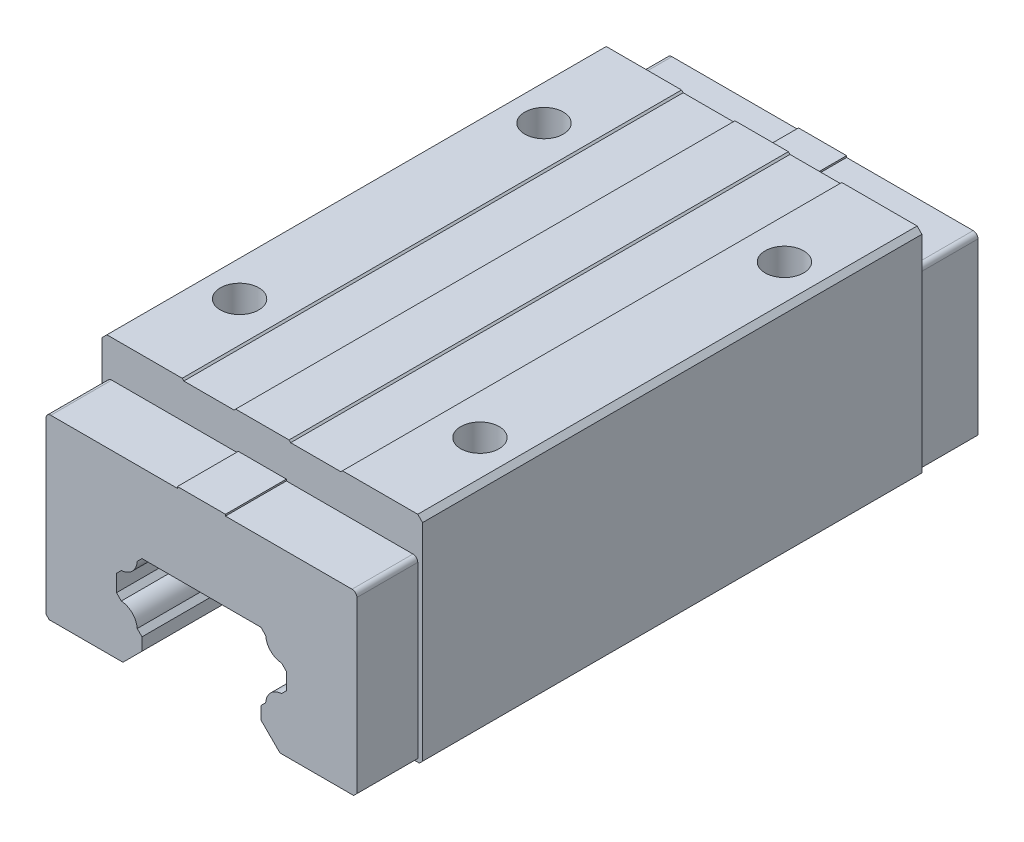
ISO-10303-21;
HEADER;
FILE_DESCRIPTION(('STEP AP214'),'2;1');
FILE_NAME('part.step','',(''),(''),'','','');
FILE_SCHEMA(('AUTOMOTIVE_DESIGN { 1 0 10303 214 1 1 1 1 }'));
ENDSEC;
DATA;
#1=APPLICATION_CONTEXT('core data for automotive mechanical design processes');
#2=APPLICATION_PROTOCOL_DEFINITION('international standard','automotive_design',2000,#1);
#3=PRODUCT_CONTEXT('',#1,'mechanical');
#4=PRODUCT('Part','Part','',(#3));
#5=PRODUCT_RELATED_PRODUCT_CATEGORY('part','',(#4));
#6=PRODUCT_DEFINITION_FORMATION('','',#4);
#7=PRODUCT_DEFINITION_CONTEXT('part definition',#1,'design');
#8=PRODUCT_DEFINITION('design','',#6,#7);
#9=PRODUCT_DEFINITION_SHAPE('','',#8);
#10=(LENGTH_UNIT() NAMED_UNIT(*) SI_UNIT(.MILLI.,.METRE.));
#11=(NAMED_UNIT(*) PLANE_ANGLE_UNIT() SI_UNIT($,.RADIAN.));
#12=(NAMED_UNIT(*) SI_UNIT($,.STERADIAN.) SOLID_ANGLE_UNIT());
#13=UNCERTAINTY_MEASURE_WITH_UNIT(LENGTH_MEASURE(1.E-05),#10,'distance_accuracy_value','');
#14=(GEOMETRIC_REPRESENTATION_CONTEXT(3) GLOBAL_UNCERTAINTY_ASSIGNED_CONTEXT((#13)) GLOBAL_UNIT_ASSIGNED_CONTEXT((#10,
#11,#12)) REPRESENTATION_CONTEXT('',''));
#15=CARTESIAN_POINT('',(0.,0.,0.));
#16=DIRECTION('',(0.,0.,1.));
#17=DIRECTION('',(1.,0.,0.));
#18=AXIS2_PLACEMENT_3D('',#15,#16,#17);
#19=CARTESIAN_POINT('',(-48.5,13.,-96.90005));
#20=DIRECTION('',(0.,1.,0.));
#21=DIRECTION('',(0.,0.,1.));
#22=AXIS2_PLACEMENT_3D('',#19,#20,#21);
#23=PLANE('',#22);
#24=DIRECTION('',(1.,0.,0.));
#25=VECTOR('',#24,1.);
#26=CARTESIAN_POINT('',(0.,13.,-96.9));
#27=LINE('',#26,#25);
#28=CARTESIAN_POINT('',(-47.5,13.,-96.9));
#29=VERTEX_POINT('',#28);
#30=CARTESIAN_POINT('',(-24.4999999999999,12.9999999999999,-96.9));
#31=VERTEX_POINT('',#30);
#32=EDGE_CURVE('E485',#29,#31,#27,.T.);
#33=ORIENTED_EDGE('',*,*,#32,.T.);
#34=DIRECTION('',(0.,0.,1.));
#35=VECTOR('',#34,1.);
#36=CARTESIAN_POINT('',(-24.4999999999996,12.9999999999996,118.2364125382));
#37=LINE('',#36,#35);
#38=CARTESIAN_POINT('',(-24.4999999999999,12.9999999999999,96.9));
#39=VERTEX_POINT('',#38);
#40=EDGE_CURVE('E649',#31,#39,#37,.T.);
#41=ORIENTED_EDGE('',*,*,#40,.T.);
#42=DIRECTION('',(1.,0.,0.));
#43=VECTOR('',#42,1.);
#44=CARTESIAN_POINT('',(0.,13.,96.9));
#45=LINE('',#44,#43);
#46=CARTESIAN_POINT('',(-47.5,13.,96.9));
#47=VERTEX_POINT('',#46);
#48=EDGE_CURVE('E653',#47,#39,#45,.T.);
#49=ORIENTED_EDGE('',*,*,#48,.F.);
#50=DIRECTION('',(0.,0.,1.));
#51=VECTOR('',#50,1.);
#52=CARTESIAN_POINT('',(-47.5,13.,96.90005));
#53=LINE('',#52,#51);
#54=CARTESIAN_POINT('',(-47.5,13.,77.9));
#55=VERTEX_POINT('',#54);
#56=EDGE_CURVE('E665',#55,#47,#53,.T.);
#57=ORIENTED_EDGE('',*,*,#56,.F.);
#58=DIRECTION('',(1.,0.,0.));
#59=VECTOR('',#58,1.);
#60=CARTESIAN_POINT('',(-48.5,13.,77.9));
#61=LINE('',#60,#59);
#62=CARTESIAN_POINT('',(-48.5,13.,77.9));
#63=VERTEX_POINT('',#62);
#64=EDGE_CURVE('E658',#63,#55,#61,.T.);
#65=ORIENTED_EDGE('',*,*,#64,.F.);
#66=DIRECTION('',(0.,0.,1.));
#67=VECTOR('',#66,1.);
#68=CARTESIAN_POINT('',(-48.5,13.,-79.31421356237));
#69=LINE('',#68,#67);
#70=CARTESIAN_POINT('',(-48.5,13.,-77.9));
#71=VERTEX_POINT('',#70);
#72=EDGE_CURVE('E766',#63,#71,#69,.F.);
#73=ORIENTED_EDGE('',*,*,#72,.T.);
#74=DIRECTION('',(1.,0.,0.));
#75=VECTOR('',#74,1.);
#76=CARTESIAN_POINT('',(-48.5,13.,-77.9));
#77=LINE('',#76,#75);
#78=CARTESIAN_POINT('',(-47.5,13.,-77.9));
#79=VERTEX_POINT('',#78);
#80=EDGE_CURVE('E684',#79,#71,#77,.F.);
#81=ORIENTED_EDGE('',*,*,#80,.F.);
#82=DIRECTION('',(0.,0.,1.));
#83=VECTOR('',#82,1.);
#84=CARTESIAN_POINT('',(-47.5,13.,-96.90005));
#85=LINE('',#84,#83);
#86=EDGE_CURVE('E512',#79,#29,#85,.F.);
#87=ORIENTED_EDGE('',*,*,#86,.T.);
#88=EDGE_LOOP('',(#33,#41,#49,#57,#65,#73,#81,#87));
#89=FACE_BOUND('',#88,.T.);
#90=ADVANCED_FACE('F15',(#89),#23,.F.);
#91=CARTESIAN_POINT('',(-18.55,18.95,118.2364125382));
#92=DIRECTION('',(-0.707106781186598,0.707106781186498,0.));
#93=DIRECTION('',(-0.707106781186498,-0.707106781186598,0.));
#94=AXIS2_PLACEMENT_3D('',#91,#92,#93);
#95=PLANE('',#94);
#96=DIRECTION('',(0.,0.,1.));
#97=VECTOR('',#96,1.);
#98=CARTESIAN_POINT('',(-18.55,18.95,118.2364125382));
#99=LINE('',#98,#97);
#100=CARTESIAN_POINT('',(-18.55,18.95,-96.9));
#101=VERTEX_POINT('',#100);
#102=CARTESIAN_POINT('',(-18.55,18.95,96.9));
#103=VERTEX_POINT('',#102);
#104=EDGE_CURVE('E638',#101,#103,#99,.T.);
#105=ORIENTED_EDGE('',*,*,#104,.T.);
#106=DIRECTION('',(0.707106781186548,0.707106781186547,0.));
#107=VECTOR('',#106,1.);
#108=CARTESIAN_POINT('',(-24.5,13.,96.9));
#109=LINE('',#108,#107);
#110=EDGE_CURVE('E644',#39,#103,#109,.T.);
#111=ORIENTED_EDGE('',*,*,#110,.F.);
#112=ORIENTED_EDGE('',*,*,#40,.F.);
#113=DIRECTION('',(0.707106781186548,0.707106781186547,0.));
#114=VECTOR('',#113,1.);
#115=CARTESIAN_POINT('',(-24.5,13.,-96.9));
#116=LINE('',#115,#114);
#117=EDGE_CURVE('E445',#31,#101,#116,.T.);
#118=ORIENTED_EDGE('',*,*,#117,.T.);
#119=EDGE_LOOP('',(#105,#111,#112,#118));
#120=FACE_BOUND('',#119,.T.);
#121=ADVANCED_FACE('F1420',(#120),#95,.F.);
#122=CARTESIAN_POINT('',(-18.55,22.85,118.2364125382));
#123=DIRECTION('',(-1.,0.,0.));
#124=DIRECTION('',(0.,0.,1.));
#125=AXIS2_PLACEMENT_3D('',#122,#123,#124);
#126=PLANE('',#125);
#127=DIRECTION('',(0.,1.,0.));
#128=VECTOR('',#127,1.);
#129=CARTESIAN_POINT('',(-18.55,0.,-96.9));
#130=LINE('',#129,#128);
#131=CARTESIAN_POINT('',(-18.5500000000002,22.8499999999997,-96.9));
#132=VERTEX_POINT('',#131);
#133=EDGE_CURVE('E441',#101,#132,#130,.T.);
#134=ORIENTED_EDGE('',*,*,#133,.T.);
#135=DIRECTION('',(0.,0.,1.));
#136=VECTOR('',#135,1.);
#137=CARTESIAN_POINT('',(-18.5500000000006,22.8499999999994,118.2364125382));
#138=LINE('',#137,#136);
#139=CARTESIAN_POINT('',(-18.5500000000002,22.8499999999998,96.9));
#140=VERTEX_POINT('',#139);
#141=EDGE_CURVE('E635',#132,#140,#138,.T.);
#142=ORIENTED_EDGE('',*,*,#141,.T.);
#143=DIRECTION('',(0.,1.,0.));
#144=VECTOR('',#143,1.);
#145=CARTESIAN_POINT('',(-18.55,0.,96.9));
#146=LINE('',#145,#144);
#147=EDGE_CURVE('E641',#103,#140,#146,.T.);
#148=ORIENTED_EDGE('',*,*,#147,.F.);
#149=ORIENTED_EDGE('',*,*,#104,.F.);
#150=EDGE_LOOP('',(#134,#142,#148,#149));
#151=FACE_BOUND('',#150,.T.);
#152=ADVANCED_FACE('F1418',(#151),#126,.F.);
#153=CARTESIAN_POINT('',(-26.5,30.8,118.2364125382));
#154=DIRECTION('',(-0.707106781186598,-0.707106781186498,0.));
#155=DIRECTION('',(0.707106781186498,-0.707106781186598,0.));
#156=AXIS2_PLACEMENT_3D('',#153,#154,#155);
#157=PLANE('',#156);
#158=ORIENTED_EDGE('',*,*,#141,.F.);
#159=DIRECTION('',(-0.707106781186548,0.707106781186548,0.));
#160=VECTOR('',#159,1.);
#161=CARTESIAN_POINT('',(-18.55,22.85,-96.9));
#162=LINE('',#161,#160);
#163=CARTESIAN_POINT('',(-20.046151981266,24.3461519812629,-96.9));
#164=VERTEX_POINT('',#163);
#165=EDGE_CURVE('E440',#132,#164,#162,.T.);
#166=ORIENTED_EDGE('',*,*,#165,.T.);
#167=DIRECTION('',(0.,0.,-1.));
#168=VECTOR('',#167,1.);
#169=CARTESIAN_POINT('',(-20.0461519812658,24.3461519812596,111.8906637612));
#170=LINE('',#169,#168);
#171=CARTESIAN_POINT('',(-20.046151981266,24.3461519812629,96.9));
#172=VERTEX_POINT('',#171);
#173=EDGE_CURVE('E414',#172,#164,#170,.T.);
#174=ORIENTED_EDGE('',*,*,#173,.F.);
#175=DIRECTION('',(-0.707106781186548,0.707106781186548,0.));
#176=VECTOR('',#175,1.);
#177=CARTESIAN_POINT('',(-18.55,22.85,96.9));
#178=LINE('',#177,#176);
#179=EDGE_CURVE('E643',#140,#172,#178,.T.);
#180=ORIENTED_EDGE('',*,*,#179,.F.);
#181=EDGE_LOOP('',(#158,#166,#174,#180));
#182=FACE_BOUND('',#181,.T.);
#183=ADVANCED_FACE('F1415',(#182),#157,.F.);
#184=CARTESIAN_POINT('',(-25.33574945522,24.01425054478,111.8906637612));
#185=DIRECTION('',(0.,0.,-1.));
#186=DIRECTION('',(-1.,0.,0.));
#187=AXIS2_PLACEMENT_3D('',#184,#185,#186);
#188=CYLINDRICAL_SURFACE('',#187,5.3);
#189=ORIENTED_EDGE('',*,*,#173,.T.);
#190=CARTESIAN_POINT('',(-25.33574945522,24.01425054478,-96.9));
#191=DIRECTION('',(0.,0.,-1.));
#192=DIRECTION('',(-1.,0.,0.));
#193=AXIS2_PLACEMENT_3D('',#190,#191,#192);
#194=CIRCLE('',#193,5.3);
#195=CARTESIAN_POINT('',(-25.003848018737,29.3038480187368,-96.9));
#196=VERTEX_POINT('',#195);
#197=EDGE_CURVE('E18',#164,#196,#194,.F.);
#198=ORIENTED_EDGE('',*,*,#197,.T.);
#199=DIRECTION('',(0.,0.,1.));
#200=VECTOR('',#199,1.);
#201=CARTESIAN_POINT('',(-25.0038480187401,29.3038480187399,118.2364125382));
#202=LINE('',#201,#200);
#203=CARTESIAN_POINT('',(-25.003848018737,29.3038480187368,96.9));
#204=VERTEX_POINT('',#203);
#205=EDGE_CURVE('E421',#196,#204,#202,.T.);
#206=ORIENTED_EDGE('',*,*,#205,.T.);
#207=CARTESIAN_POINT('',(-25.33574945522,24.01425054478,96.9));
#208=DIRECTION('',(0.,0.,-1.));
#209=DIRECTION('',(-1.,0.,0.));
#210=AXIS2_PLACEMENT_3D('',#207,#208,#209);
#211=CIRCLE('',#210,5.3);
#212=EDGE_CURVE('E827',#172,#204,#211,.F.);
#213=ORIENTED_EDGE('',*,*,#212,.F.);
#214=EDGE_LOOP('',(#189,#198,#206,#213));
#215=FACE_BOUND('',#214,.T.);
#216=ADVANCED_FACE('F439',(#215),#188,.T.);
#217=CARTESIAN_POINT('',(-26.5,30.8,118.2364125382));
#218=DIRECTION('',(-0.707106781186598,-0.707106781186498,0.));
#219=DIRECTION('',(0.707106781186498,-0.707106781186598,0.));
#220=AXIS2_PLACEMENT_3D('',#217,#218,#219);
#221=PLANE('',#220);
#222=DIRECTION('',(0.,0.,1.));
#223=VECTOR('',#222,1.);
#224=CARTESIAN_POINT('',(-26.5,30.8,-96.90005));
#225=LINE('',#224,#223);
#226=CARTESIAN_POINT('',(-26.5,30.8,-96.9));
#227=VERTEX_POINT('',#226);
#228=CARTESIAN_POINT('',(-26.5,30.8,96.9));
#229=VERTEX_POINT('',#228);
#230=EDGE_CURVE('E427',#227,#229,#225,.T.);
#231=ORIENTED_EDGE('',*,*,#230,.T.);
#232=DIRECTION('',(-0.707106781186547,0.707106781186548,0.));
#233=VECTOR('',#232,1.);
#234=CARTESIAN_POINT('',(-25.00384801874,29.30384801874,96.9));
#235=LINE('',#234,#233);
#236=EDGE_CURVE('E426',#204,#229,#235,.T.);
#237=ORIENTED_EDGE('',*,*,#236,.F.);
#238=ORIENTED_EDGE('',*,*,#205,.F.);
#239=DIRECTION('',(-0.707106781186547,0.707106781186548,0.));
#240=VECTOR('',#239,1.);
#241=CARTESIAN_POINT('',(-25.00384801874,29.30384801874,-96.9));
#242=LINE('',#241,#240);
#243=EDGE_CURVE('E425',#196,#227,#242,.T.);
#244=ORIENTED_EDGE('',*,*,#243,.T.);
#245=EDGE_LOOP('',(#231,#237,#238,#244));
#246=FACE_BOUND('',#245,.T.);
#247=ADVANCED_FACE('F424',(#246),#221,.F.);
#248=CARTESIAN_POINT('',(-26.5,0.,-96.90005));
#249=DIRECTION('',(-1.,0.,0.));
#250=DIRECTION('',(0.,0.,1.));
#251=AXIS2_PLACEMENT_3D('',#248,#249,#250);
#252=PLANE('',#251);
#253=DIRECTION('',(0.,0.,1.));
#254=VECTOR('',#253,1.);
#255=CARTESIAN_POINT('',(-26.5000000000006,36.0500000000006,108.1429978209));
#256=LINE('',#255,#254);
#257=CARTESIAN_POINT('',(-26.5000000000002,36.0500000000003,-96.9));
#258=VERTEX_POINT('',#257);
#259=CARTESIAN_POINT('',(-26.5000000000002,36.0500000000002,96.9));
#260=VERTEX_POINT('',#259);
#261=EDGE_CURVE('E621',#258,#260,#256,.T.);
#262=ORIENTED_EDGE('',*,*,#261,.T.);
#263=DIRECTION('',(0.,1.,0.));
#264=VECTOR('',#263,1.);
#265=CARTESIAN_POINT('',(-26.5,0.,96.9));
#266=LINE('',#265,#264);
#267=EDGE_CURVE('E626',#229,#260,#266,.T.);
#268=ORIENTED_EDGE('',*,*,#267,.F.);
#269=ORIENTED_EDGE('',*,*,#230,.F.);
#270=DIRECTION('',(0.,1.,0.));
#271=VECTOR('',#270,1.);
#272=CARTESIAN_POINT('',(-26.5,0.,-96.9));
#273=LINE('',#272,#271);
#274=EDGE_CURVE('E437',#227,#258,#273,.T.);
#275=ORIENTED_EDGE('',*,*,#274,.T.);
#276=EDGE_LOOP('',(#262,#268,#269,#275));
#277=FACE_BOUND('',#276,.T.);
#278=ADVANCED_FACE('F1407',(#277),#252,.F.);
#279=CARTESIAN_POINT('',(-18.55,44.,108.1429978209));
#280=DIRECTION('',(-0.707106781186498,0.707106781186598,0.));
#281=DIRECTION('',(-0.707106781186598,-0.707106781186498,0.));
#282=AXIS2_PLACEMENT_3D('',#279,#280,#281);
#283=PLANE('',#282);
#284=ORIENTED_EDGE('',*,*,#261,.F.);
#285=DIRECTION('',(0.707106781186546,0.707106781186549,0.));
#286=VECTOR('',#285,1.);
#287=CARTESIAN_POINT('',(-26.5,36.05,-96.9));
#288=LINE('',#287,#286);
#289=CARTESIAN_POINT('',(-25.0038480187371,37.546151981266,-96.9));
#290=VERTEX_POINT('',#289);
#291=EDGE_CURVE('E746',#258,#290,#288,.T.);
#292=ORIENTED_EDGE('',*,*,#291,.T.);
#293=DIRECTION('',(0.,0.,-1.));
#294=VECTOR('',#293,1.);
#295=CARTESIAN_POINT('',(-25.0038480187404,37.5461519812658,111.8906637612));
#296=LINE('',#295,#294);
#297=CARTESIAN_POINT('',(-25.0038480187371,37.546151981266,96.9));
#298=VERTEX_POINT('',#297);
#299=EDGE_CURVE('E619',#298,#290,#296,.T.);
#300=ORIENTED_EDGE('',*,*,#299,.F.);
#301=DIRECTION('',(0.707106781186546,0.707106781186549,0.));
#302=VECTOR('',#301,1.);
#303=CARTESIAN_POINT('',(-26.5,36.05,96.9));
#304=LINE('',#303,#302);
#305=EDGE_CURVE('E628',#260,#298,#304,.T.);
#306=ORIENTED_EDGE('',*,*,#305,.F.);
#307=EDGE_LOOP('',(#284,#292,#300,#306));
#308=FACE_BOUND('',#307,.T.);
#309=ADVANCED_FACE('F1404',(#308),#283,.F.);
#310=CARTESIAN_POINT('',(-25.33574945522,42.83574945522,111.8906637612));
#311=DIRECTION('',(0.,0.,-1.));
#312=DIRECTION('',(-1.,0.,0.));
#313=AXIS2_PLACEMENT_3D('',#310,#311,#312);
#314=CYLINDRICAL_SURFACE('',#313,5.3);
#315=ORIENTED_EDGE('',*,*,#299,.T.);
#316=CARTESIAN_POINT('',(-25.33574945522,42.83574945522,-96.9));
#317=DIRECTION('',(0.,0.,-1.));
#318=DIRECTION('',(-1.,0.,0.));
#319=AXIS2_PLACEMENT_3D('',#316,#317,#318);
#320=CIRCLE('',#319,5.3);
#321=CARTESIAN_POINT('',(-20.0461519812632,42.503848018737,-96.9));
#322=VERTEX_POINT('',#321);
#323=EDGE_CURVE('E834',#290,#322,#320,.F.);
#324=ORIENTED_EDGE('',*,*,#323,.T.);
#325=DIRECTION('',(0.,0.,1.));
#326=VECTOR('',#325,1.);
#327=CARTESIAN_POINT('',(-20.0461519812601,42.5038480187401,108.1429978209));
#328=LINE('',#327,#326);
#329=CARTESIAN_POINT('',(-20.0461519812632,42.503848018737,96.9));
#330=VERTEX_POINT('',#329);
#331=EDGE_CURVE('E614',#322,#330,#328,.T.);
#332=ORIENTED_EDGE('',*,*,#331,.T.);
#333=CARTESIAN_POINT('',(-25.33574945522,42.83574945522,96.9));
#334=DIRECTION('',(0.,0.,-1.));
#335=DIRECTION('',(-1.,0.,0.));
#336=AXIS2_PLACEMENT_3D('',#333,#334,#335);
#337=CIRCLE('',#336,5.3);
#338=EDGE_CURVE('E825',#298,#330,#337,.F.);
#339=ORIENTED_EDGE('',*,*,#338,.F.);
#340=EDGE_LOOP('',(#315,#324,#332,#339));
#341=FACE_BOUND('',#340,.T.);
#342=ADVANCED_FACE('F1400',(#341),#314,.T.);
#343=CARTESIAN_POINT('',(-18.55,44.,108.1429978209));
#344=DIRECTION('',(-0.707106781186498,0.707106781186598,0.));
#345=DIRECTION('',(-0.707106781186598,-0.707106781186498,0.));
#346=AXIS2_PLACEMENT_3D('',#343,#344,#345);
#347=PLANE('',#346);
#348=DIRECTION('',(0.,0.,1.));
#349=VECTOR('',#348,1.);
#350=CARTESIAN_POINT('',(-18.55,44.,-96.90005));
#351=LINE('',#350,#349);
#352=CARTESIAN_POINT('',(-18.55,44.,-96.9));
#353=VERTEX_POINT('',#352);
#354=CARTESIAN_POINT('',(-18.55,44.,96.9));
#355=VERTEX_POINT('',#354);
#356=EDGE_CURVE('E603',#353,#355,#351,.T.);
#357=ORIENTED_EDGE('',*,*,#356,.T.);
#358=DIRECTION('',(0.707106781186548,0.707106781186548,0.));
#359=VECTOR('',#358,1.);
#360=CARTESIAN_POINT('',(-20.04615198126,42.50384801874,96.9));
#361=LINE('',#360,#359);
#362=EDGE_CURVE('E609',#330,#355,#361,.T.);
#363=ORIENTED_EDGE('',*,*,#362,.F.);
#364=ORIENTED_EDGE('',*,*,#331,.F.);
#365=DIRECTION('',(0.707106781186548,0.707106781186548,0.));
#366=VECTOR('',#365,1.);
#367=CARTESIAN_POINT('',(-20.04615198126,42.50384801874,-96.9));
#368=LINE('',#367,#366);
#369=EDGE_CURVE('E742',#322,#353,#368,.T.);
#370=ORIENTED_EDGE('',*,*,#369,.T.);
#371=EDGE_LOOP('',(#357,#363,#364,#370));
#372=FACE_BOUND('',#371,.T.);
#373=ADVANCED_FACE('F1396',(#372),#347,.F.);
#374=CARTESIAN_POINT('',(-26.5,44.,-96.90005));
#375=DIRECTION('',(0.,1.,0.));
#376=DIRECTION('',(0.,0.,1.));
#377=AXIS2_PLACEMENT_3D('',#374,#375,#376);
#378=PLANE('',#377);
#379=ORIENTED_EDGE('',*,*,#356,.F.);
#380=DIRECTION('',(1.,0.,0.));
#381=VECTOR('',#380,1.);
#382=CARTESIAN_POINT('',(0.,44.,-96.9));
#383=LINE('',#382,#381);
#384=CARTESIAN_POINT('',(18.55,44.,-96.9));
#385=VERTEX_POINT('',#384);
#386=EDGE_CURVE('E738',#353,#385,#383,.T.);
#387=ORIENTED_EDGE('',*,*,#386,.T.);
#388=DIRECTION('',(0.,0.,1.));
#389=VECTOR('',#388,1.);
#390=CARTESIAN_POINT('',(18.55,44.,108.1429978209));
#391=LINE('',#390,#389);
#392=CARTESIAN_POINT('',(18.55,44.,96.9));
#393=VERTEX_POINT('',#392);
#394=EDGE_CURVE('E600',#385,#393,#391,.T.);
#395=ORIENTED_EDGE('',*,*,#394,.T.);
#396=DIRECTION('',(1.,0.,0.));
#397=VECTOR('',#396,1.);
#398=CARTESIAN_POINT('',(0.,44.,96.9));
#399=LINE('',#398,#397);
#400=EDGE_CURVE('E606',#355,#393,#399,.T.);
#401=ORIENTED_EDGE('',*,*,#400,.F.);
#402=EDGE_LOOP('',(#379,#387,#395,#401));
#403=FACE_BOUND('',#402,.T.);
#404=ADVANCED_FACE('F1392',(#403),#378,.F.);
#405=CARTESIAN_POINT('',(18.55,44.,108.1429978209));
#406=DIRECTION('',(0.707106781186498,0.707106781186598,0.));
#407=DIRECTION('',(-0.707106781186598,0.707106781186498,0.));
#408=AXIS2_PLACEMENT_3D('',#405,#406,#407);
#409=PLANE('',#408);
#410=ORIENTED_EDGE('',*,*,#394,.F.);
#411=DIRECTION('',(0.707106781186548,-0.707106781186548,0.));
#412=VECTOR('',#411,1.);
#413=CARTESIAN_POINT('',(18.55,44.,-96.9));
#414=LINE('',#413,#412);
#415=CARTESIAN_POINT('',(20.046151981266,42.5038480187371,-96.9));
#416=VERTEX_POINT('',#415);
#417=EDGE_CURVE('E741',#385,#416,#414,.T.);
#418=ORIENTED_EDGE('',*,*,#417,.T.);
#419=DIRECTION('',(0.,0.,-1.));
#420=VECTOR('',#419,1.);
#421=CARTESIAN_POINT('',(20.0461519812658,42.5038480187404,111.8906637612));
#422=LINE('',#421,#420);
#423=CARTESIAN_POINT('',(20.046151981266,42.5038480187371,96.9));
#424=VERTEX_POINT('',#423);
#425=EDGE_CURVE('E598',#424,#416,#422,.T.);
#426=ORIENTED_EDGE('',*,*,#425,.F.);
#427=DIRECTION('',(0.707106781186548,-0.707106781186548,0.));
#428=VECTOR('',#427,1.);
#429=CARTESIAN_POINT('',(18.55,44.,96.9));
#430=LINE('',#429,#428);
#431=EDGE_CURVE('E608',#393,#424,#430,.T.);
#432=ORIENTED_EDGE('',*,*,#431,.F.);
#433=EDGE_LOOP('',(#410,#418,#426,#432));
#434=FACE_BOUND('',#433,.T.);
#435=ADVANCED_FACE('F1388',(#434),#409,.F.);
#436=CARTESIAN_POINT('',(25.33574945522,42.83574945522,111.8906637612));
#437=DIRECTION('',(0.,0.,-1.));
#438=DIRECTION('',(-1.,0.,0.));
#439=AXIS2_PLACEMENT_3D('',#436,#437,#438);
#440=CYLINDRICAL_SURFACE('',#439,5.3);
#441=ORIENTED_EDGE('',*,*,#425,.T.);
#442=CARTESIAN_POINT('',(25.33574945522,42.83574945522,-96.9));
#443=DIRECTION('',(0.,0.,-1.));
#444=DIRECTION('',(-1.,0.,0.));
#445=AXIS2_PLACEMENT_3D('',#442,#443,#444);
#446=CIRCLE('',#445,5.3);
#447=CARTESIAN_POINT('',(25.0038480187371,37.5461519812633,-96.9));
#448=VERTEX_POINT('',#447);
#449=EDGE_CURVE('E832',#416,#448,#446,.F.);
#450=ORIENTED_EDGE('',*,*,#449,.T.);
#451=DIRECTION('',(0.,0.,1.));
#452=VECTOR('',#451,1.);
#453=CARTESIAN_POINT('',(25.0038480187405,37.5461519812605,108.1429978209));
#454=LINE('',#453,#452);
#455=CARTESIAN_POINT('',(25.0038480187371,37.5461519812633,96.9));
#456=VERTEX_POINT('',#455);
#457=EDGE_CURVE('E593',#448,#456,#454,.T.);
#458=ORIENTED_EDGE('',*,*,#457,.T.);
#459=CARTESIAN_POINT('',(25.33574945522,42.83574945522,96.9));
#460=DIRECTION('',(0.,0.,-1.));
#461=DIRECTION('',(-1.,0.,0.));
#462=AXIS2_PLACEMENT_3D('',#459,#460,#461);
#463=CIRCLE('',#462,5.3);
#464=EDGE_CURVE('E823',#424,#456,#463,.F.);
#465=ORIENTED_EDGE('',*,*,#464,.F.);
#466=EDGE_LOOP('',(#441,#450,#458,#465));
#467=FACE_BOUND('',#466,.T.);
#468=ADVANCED_FACE('F1384',(#467),#440,.T.);
#469=CARTESIAN_POINT('',(18.55,44.,108.1429978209));
#470=DIRECTION('',(0.707106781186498,0.707106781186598,0.));
#471=DIRECTION('',(-0.707106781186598,0.707106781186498,0.));
#472=AXIS2_PLACEMENT_3D('',#469,#470,#471);
#473=PLANE('',#472);
#474=DIRECTION('',(0.,0.,-1.));
#475=VECTOR('',#474,1.);
#476=CARTESIAN_POINT('',(26.5,36.05,-96.90005));
#477=LINE('',#476,#475);
#478=CARTESIAN_POINT('',(26.5,36.05,-96.9));
#479=VERTEX_POINT('',#478);
#480=CARTESIAN_POINT('',(26.5,36.05,96.9));
#481=VERTEX_POINT('',#480);
#482=EDGE_CURVE('E582',#479,#481,#477,.F.);
#483=ORIENTED_EDGE('',*,*,#482,.T.);
#484=DIRECTION('',(0.707106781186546,-0.707106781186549,0.));
#485=VECTOR('',#484,1.);
#486=CARTESIAN_POINT('',(25.00384801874,37.54615198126,96.9));
#487=LINE('',#486,#485);
#488=EDGE_CURVE('E588',#456,#481,#487,.T.);
#489=ORIENTED_EDGE('',*,*,#488,.F.);
#490=ORIENTED_EDGE('',*,*,#457,.F.);
#491=DIRECTION('',(0.707106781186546,-0.707106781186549,0.));
#492=VECTOR('',#491,1.);
#493=CARTESIAN_POINT('',(25.00384801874,37.54615198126,-96.9));
#494=LINE('',#493,#492);
#495=EDGE_CURVE('E735',#448,#479,#494,.T.);
#496=ORIENTED_EDGE('',*,*,#495,.T.);
#497=EDGE_LOOP('',(#483,#489,#490,#496));
#498=FACE_BOUND('',#497,.T.);
#499=ADVANCED_FACE('F1380',(#498),#473,.F.);
#500=CARTESIAN_POINT('',(26.5,0.,-96.90005));
#501=DIRECTION('',(1.,0.,0.));
#502=DIRECTION('',(0.,0.,-1.));
#503=AXIS2_PLACEMENT_3D('',#500,#501,#502);
#504=PLANE('',#503);
#505=ORIENTED_EDGE('',*,*,#482,.F.);
#506=DIRECTION('',(0.,1.,0.));
#507=VECTOR('',#506,1.);
#508=CARTESIAN_POINT('',(26.5,0.,-96.9));
#509=LINE('',#508,#507);
#510=CARTESIAN_POINT('',(26.5,30.8,-96.9));
#511=VERTEX_POINT('',#510);
#512=EDGE_CURVE('E731',#479,#511,#509,.F.);
#513=ORIENTED_EDGE('',*,*,#512,.T.);
#514=DIRECTION('',(0.,0.,1.));
#515=VECTOR('',#514,1.);
#516=CARTESIAN_POINT('',(26.5,30.8,118.2364125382));
#517=LINE('',#516,#515);
#518=CARTESIAN_POINT('',(26.5,30.8,96.9));
#519=VERTEX_POINT('',#518);
#520=EDGE_CURVE('E579',#511,#519,#517,.T.);
#521=ORIENTED_EDGE('',*,*,#520,.T.);
#522=DIRECTION('',(0.,1.,0.));
#523=VECTOR('',#522,1.);
#524=CARTESIAN_POINT('',(26.5,0.,96.9));
#525=LINE('',#524,#523);
#526=EDGE_CURVE('E585',#481,#519,#525,.F.);
#527=ORIENTED_EDGE('',*,*,#526,.F.);
#528=EDGE_LOOP('',(#505,#513,#521,#527));
#529=FACE_BOUND('',#528,.T.);
#530=ADVANCED_FACE('F1376',(#529),#504,.F.);
#531=CARTESIAN_POINT('',(26.5,30.8,118.2364125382));
#532=DIRECTION('',(0.707106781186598,-0.707106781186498,0.));
#533=DIRECTION('',(0.707106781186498,0.707106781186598,0.));
#534=AXIS2_PLACEMENT_3D('',#531,#532,#533);
#535=PLANE('',#534);
#536=ORIENTED_EDGE('',*,*,#520,.F.);
#537=DIRECTION('',(-0.707106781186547,-0.707106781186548,0.));
#538=VECTOR('',#537,1.);
#539=CARTESIAN_POINT('',(26.5,30.8,-96.9));
#540=LINE('',#539,#538);
#541=CARTESIAN_POINT('',(25.0038480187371,29.303848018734,-96.9));
#542=VERTEX_POINT('',#541);
#543=EDGE_CURVE('E734',#511,#542,#540,.T.);
#544=ORIENTED_EDGE('',*,*,#543,.T.);
#545=DIRECTION('',(0.,0.,-1.));
#546=VECTOR('',#545,1.);
#547=CARTESIAN_POINT('',(25.0038480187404,29.3038480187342,111.8906637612));
#548=LINE('',#547,#546);
#549=CARTESIAN_POINT('',(25.0038480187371,29.303848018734,96.9));
#550=VERTEX_POINT('',#549);
#551=EDGE_CURVE('E567',#550,#542,#548,.T.);
#552=ORIENTED_EDGE('',*,*,#551,.F.);
#553=DIRECTION('',(-0.707106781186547,-0.707106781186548,0.));
#554=VECTOR('',#553,1.);
#555=CARTESIAN_POINT('',(26.5,30.8,96.9));
#556=LINE('',#555,#554);
#557=EDGE_CURVE('E587',#519,#550,#556,.T.);
#558=ORIENTED_EDGE('',*,*,#557,.F.);
#559=EDGE_LOOP('',(#536,#544,#552,#558));
#560=FACE_BOUND('',#559,.T.);
#561=ADVANCED_FACE('F1372',(#560),#535,.F.);
#562=CARTESIAN_POINT('',(25.33574945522,24.01425054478,111.8906637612));
#563=DIRECTION('',(0.,0.,-1.));
#564=DIRECTION('',(-1.,0.,0.));
#565=AXIS2_PLACEMENT_3D('',#562,#563,#564);
#566=CYLINDRICAL_SURFACE('',#565,5.3);
#567=ORIENTED_EDGE('',*,*,#551,.T.);
#568=CARTESIAN_POINT('',(25.33574945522,24.01425054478,-96.9));
#569=DIRECTION('',(0.,0.,-1.));
#570=DIRECTION('',(-1.,0.,0.));
#571=AXIS2_PLACEMENT_3D('',#568,#569,#570);
#572=CIRCLE('',#571,5.3);
#573=CARTESIAN_POINT('',(20.0461519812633,24.3461519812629,-96.9));
#574=VERTEX_POINT('',#573);
#575=EDGE_CURVE('E829',#542,#574,#572,.F.);
#576=ORIENTED_EDGE('',*,*,#575,.T.);
#577=DIRECTION('',(0.,0.,1.));
#578=VECTOR('',#577,1.);
#579=CARTESIAN_POINT('',(20.0461519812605,24.3461519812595,118.2364125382));
#580=LINE('',#579,#578);
#581=CARTESIAN_POINT('',(20.0461519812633,24.3461519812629,96.9));
#582=VERTEX_POINT('',#581);
#583=EDGE_CURVE('E563',#574,#582,#580,.T.);
#584=ORIENTED_EDGE('',*,*,#583,.T.);
#585=CARTESIAN_POINT('',(25.33574945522,24.01425054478,96.9));
#586=DIRECTION('',(0.,0.,-1.));
#587=DIRECTION('',(-1.,0.,0.));
#588=AXIS2_PLACEMENT_3D('',#585,#586,#587);
#589=CIRCLE('',#588,5.3);
#590=EDGE_CURVE('E821',#550,#582,#589,.F.);
#591=ORIENTED_EDGE('',*,*,#590,.F.);
#592=EDGE_LOOP('',(#567,#576,#584,#591));
#593=FACE_BOUND('',#592,.T.);
#594=ADVANCED_FACE('F1368',(#593),#566,.T.);
#595=CARTESIAN_POINT('',(26.5,30.8,118.2364125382));
#596=DIRECTION('',(0.707106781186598,-0.707106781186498,0.));
#597=DIRECTION('',(0.707106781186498,0.707106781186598,0.));
#598=AXIS2_PLACEMENT_3D('',#595,#596,#597);
#599=PLANE('',#598);
#600=DIRECTION('',(0.,0.,-1.));
#601=VECTOR('',#600,1.);
#602=CARTESIAN_POINT('',(18.55,22.85,118.2364125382));
#603=LINE('',#602,#601);
#604=CARTESIAN_POINT('',(18.55,22.8499999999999,-96.9));
#605=VERTEX_POINT('',#604);
#606=CARTESIAN_POINT('',(18.55,22.85,96.9));
#607=VERTEX_POINT('',#606);
#608=EDGE_CURVE('E566',#605,#607,#603,.F.);
#609=ORIENTED_EDGE('',*,*,#608,.T.);
#610=DIRECTION('',(-0.707106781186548,-0.707106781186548,0.));
#611=VECTOR('',#610,1.);
#612=CARTESIAN_POINT('',(20.04615198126,24.34615198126,96.9));
#613=LINE('',#612,#611);
#614=EDGE_CURVE('E575',#582,#607,#613,.T.);
#615=ORIENTED_EDGE('',*,*,#614,.F.);
#616=ORIENTED_EDGE('',*,*,#583,.F.);
#617=DIRECTION('',(-0.707106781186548,-0.707106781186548,0.));
#618=VECTOR('',#617,1.);
#619=CARTESIAN_POINT('',(20.04615198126,24.34615198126,-96.9));
#620=LINE('',#619,#618);
#621=EDGE_CURVE('E728',#574,#605,#620,.T.);
#622=ORIENTED_EDGE('',*,*,#621,.T.);
#623=EDGE_LOOP('',(#609,#615,#616,#622));
#624=FACE_BOUND('',#623,.T.);
#625=ADVANCED_FACE('F1364',(#624),#599,.F.);
#626=CARTESIAN_POINT('',(18.55,22.85,118.2364125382));
#627=DIRECTION('',(1.,0.,0.));
#628=DIRECTION('',(0.,0.,-1.));
#629=AXIS2_PLACEMENT_3D('',#626,#627,#628);
#630=PLANE('',#629);
#631=DIRECTION('',(0.,1.,0.));
#632=VECTOR('',#631,1.);
#633=CARTESIAN_POINT('',(18.55,0.,-96.9));
#634=LINE('',#633,#632);
#635=CARTESIAN_POINT('',(18.55,18.95,-96.9));
#636=VERTEX_POINT('',#635);
#637=EDGE_CURVE('E480',#605,#636,#634,.F.);
#638=ORIENTED_EDGE('',*,*,#637,.T.);
#639=DIRECTION('',(0.,0.,1.));
#640=VECTOR('',#639,1.);
#641=CARTESIAN_POINT('',(18.55,18.95,118.2364125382));
#642=LINE('',#641,#640);
#643=CARTESIAN_POINT('',(18.55,18.95,96.9));
#644=VERTEX_POINT('',#643);
#645=EDGE_CURVE('E460',#636,#644,#642,.T.);
#646=ORIENTED_EDGE('',*,*,#645,.T.);
#647=DIRECTION('',(0.,1.,0.));
#648=VECTOR('',#647,1.);
#649=CARTESIAN_POINT('',(18.55,0.,96.9));
#650=LINE('',#649,#648);
#651=EDGE_CURVE('E572',#607,#644,#650,.F.);
#652=ORIENTED_EDGE('',*,*,#651,.F.);
#653=ORIENTED_EDGE('',*,*,#608,.F.);
#654=EDGE_LOOP('',(#638,#646,#652,#653));
#655=FACE_BOUND('',#654,.T.);
#656=ADVANCED_FACE('F1360',(#655),#630,.F.);
#657=CARTESIAN_POINT('',(-37.5,56.7000000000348,-47.5));
#658=DIRECTION('',(0.,1.,0.));
#659=DIRECTION('',(-1.,0.,0.));
#660=AXIS2_PLACEMENT_3D('',#657,#658,#659);
#661=CONICAL_SURFACE('',#660,6.00000000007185,1.02974425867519);
#662=CARTESIAN_POINT('',(-37.5,56.7,-47.5));
#663=DIRECTION('',(0.,1.,0.));
#664=DIRECTION('',(0.,0.,1.));
#665=AXIS2_PLACEMENT_3D('',#662,#663,#664);
#666=CIRCLE('',#665,6.);
#667=CARTESIAN_POINT('',(-37.5,56.7,-41.5));
#668=VERTEX_POINT('',#667);
#669=EDGE_CURVE('E530',#668,#668,#666,.T.);
#670=ORIENTED_EDGE('',*,*,#669,.T.);
#671=EDGE_LOOP('',(#670));
#672=FACE_BOUND('',#671,.T.);
#673=CARTESIAN_POINT('',(-37.5,53.0948362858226,-47.5000000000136));
#674=VERTEX_POINT('',#673);
#675=VERTEX_LOOP('',#674);
#676=FACE_BOUND('',#675,.T.);
#677=ADVANCED_FACE('F1356',(#672,#676),#661,.F.);
#678=CARTESIAN_POINT('',(-37.5,56.699999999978,47.5));
#679=DIRECTION('',(0.,1.,0.));
#680=DIRECTION('',(0.,0.,1.));
#681=AXIS2_PLACEMENT_3D('',#678,#679,#680);
#682=CONICAL_SURFACE('',#681,6.00000000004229,1.02974425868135);
#683=CARTESIAN_POINT('',(-37.5,56.7,47.5));
#684=DIRECTION('',(0.,1.,0.));
#685=DIRECTION('',(0.,0.,1.));
#686=AXIS2_PLACEMENT_3D('',#683,#684,#685);
#687=CIRCLE('',#686,6.);
#688=CARTESIAN_POINT('',(-37.5,56.7,53.5));
#689=VERTEX_POINT('',#688);
#690=EDGE_CURVE('E526',#689,#689,#687,.T.);
#691=ORIENTED_EDGE('',*,*,#690,.T.);
#692=EDGE_LOOP('',(#691));
#693=FACE_BOUND('',#692,.T.);
#694=CARTESIAN_POINT('',(-37.5,53.0948362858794,47.4999999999));
#695=VERTEX_POINT('',#694);
#696=VERTEX_LOOP('',#695);
#697=FACE_BOUND('',#696,.T.);
#698=ADVANCED_FACE('F1352',(#693,#697),#682,.F.);
#699=CARTESIAN_POINT('',(37.5,56.7000000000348,-47.5));
#700=DIRECTION('',(0.,1.,0.));
#701=DIRECTION('',(-1.,0.,0.));
#702=AXIS2_PLACEMENT_3D('',#699,#700,#701);
#703=CONICAL_SURFACE('',#702,6.00000000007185,1.02974425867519);
#704=CARTESIAN_POINT('',(37.5,56.7,-47.5));
#705=DIRECTION('',(0.,1.,0.));
#706=DIRECTION('',(0.,0.,1.));
#707=AXIS2_PLACEMENT_3D('',#704,#705,#706);
#708=CIRCLE('',#707,6.);
#709=CARTESIAN_POINT('',(37.5,56.7,-41.5));
#710=VERTEX_POINT('',#709);
#711=EDGE_CURVE('E522',#710,#710,#708,.T.);
#712=ORIENTED_EDGE('',*,*,#711,.T.);
#713=EDGE_LOOP('',(#712));
#714=FACE_BOUND('',#713,.T.);
#715=CARTESIAN_POINT('',(37.5,53.0948362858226,-47.5000000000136));
#716=VERTEX_POINT('',#715);
#717=VERTEX_LOOP('',#716);
#718=FACE_BOUND('',#717,.T.);
#719=ADVANCED_FACE('F1348',(#714,#718),#703,.F.);
#720=CARTESIAN_POINT('',(37.5,56.699999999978,47.5));
#721=DIRECTION('',(0.,1.,0.));
#722=DIRECTION('',(0.,0.,1.));
#723=AXIS2_PLACEMENT_3D('',#720,#721,#722);
#724=CONICAL_SURFACE('',#723,6.00000000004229,1.02974425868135);
#725=CARTESIAN_POINT('',(37.5,56.7,47.5));
#726=DIRECTION('',(0.,1.,0.));
#727=DIRECTION('',(0.,0.,1.));
#728=AXIS2_PLACEMENT_3D('',#725,#726,#727);
#729=CIRCLE('',#728,6.);
#730=CARTESIAN_POINT('',(37.5,56.7,53.5));
#731=VERTEX_POINT('',#730);
#732=EDGE_CURVE('E507',#731,#731,#729,.T.);
#733=ORIENTED_EDGE('',*,*,#732,.T.);
#734=EDGE_LOOP('',(#733));
#735=FACE_BOUND('',#734,.T.);
#736=CARTESIAN_POINT('',(37.5,53.0948362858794,47.4999999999));
#737=VERTEX_POINT('',#736);
#738=VERTEX_LOOP('',#737);
#739=FACE_BOUND('',#738,.T.);
#740=ADVANCED_FACE('F1344',(#735,#739),#724,.F.);
#741=CARTESIAN_POINT('',(-47.5,13.,-96.90005));
#742=DIRECTION('',(0.707106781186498,0.707106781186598,0.));
#743=DIRECTION('',(-0.707106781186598,0.707106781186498,0.));
#744=AXIS2_PLACEMENT_3D('',#741,#742,#743);
#745=PLANE('',#744);
#746=DIRECTION('',(0.,0.,-1.));
#747=VECTOR('',#746,1.);
#748=CARTESIAN_POINT('',(-48.5,14.,208.6553130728));
#749=LINE('',#748,#747);
#750=CARTESIAN_POINT('',(-48.5,14.,-77.9));
#751=VERTEX_POINT('',#750);
#752=CARTESIAN_POINT('',(-48.5,14.,-96.9));
#753=VERTEX_POINT('',#752);
#754=EDGE_CURVE('E506',#751,#753,#749,.T.);
#755=ORIENTED_EDGE('',*,*,#754,.T.);
#756=DIRECTION('',(0.707106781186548,-0.707106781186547,0.));
#757=VECTOR('',#756,1.);
#758=CARTESIAN_POINT('',(-48.5,14.,-96.9));
#759=LINE('',#758,#757);
#760=EDGE_CURVE('E501',#753,#29,#759,.T.);
#761=ORIENTED_EDGE('',*,*,#760,.T.);
#762=ORIENTED_EDGE('',*,*,#86,.F.);
#763=DIRECTION('',(-0.707106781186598,0.707106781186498,0.));
#764=VECTOR('',#763,1.);
#765=CARTESIAN_POINT('',(-47.5,13.,-77.9));
#766=LINE('',#765,#764);
#767=EDGE_CURVE('E497',#751,#79,#766,.F.);
#768=ORIENTED_EDGE('',*,*,#767,.F.);
#769=EDGE_LOOP('',(#755,#761,#762,#768));
#770=FACE_BOUND('',#769,.T.);
#771=ADVANCED_FACE('F1340',(#770),#745,.F.);
#772=CARTESIAN_POINT('',(-7.5,68.5,111.9083310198));
#773=DIRECTION('',(1.,0.,0.));
#774=DIRECTION('',(0.,0.,-1.));
#775=AXIS2_PLACEMENT_3D('',#772,#773,#774);
#776=PLANE('',#775);
#777=DIRECTION('',(0.,1.,0.));
#778=VECTOR('',#777,1.);
#779=CARTESIAN_POINT('',(-7.5,0.,-96.9));
#780=LINE('',#779,#778);
#781=CARTESIAN_POINT('',(-7.5,69.,-96.9));
#782=VERTEX_POINT('',#781);
#783=CARTESIAN_POINT('',(-7.5,68.5,-96.9));
#784=VERTEX_POINT('',#783);
#785=EDGE_CURVE('E479',#782,#784,#780,.F.);
#786=ORIENTED_EDGE('',*,*,#785,.T.);
#787=DIRECTION('',(0.,0.,-1.));
#788=VECTOR('',#787,1.);
#789=CARTESIAN_POINT('',(-7.5,68.5,208.6553130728));
#790=LINE('',#789,#788);
#791=CARTESIAN_POINT('',(-7.5,68.5,-77.9));
#792=VERTEX_POINT('',#791);
#793=EDGE_CURVE('E492',#784,#792,#790,.F.);
#794=ORIENTED_EDGE('',*,*,#793,.T.);
#795=DIRECTION('',(0.,1.,0.));
#796=VECTOR('',#795,1.);
#797=CARTESIAN_POINT('',(-7.5,68.5,-77.9));
#798=LINE('',#797,#796);
#799=CARTESIAN_POINT('',(-7.5,69.,-77.9));
#800=VERTEX_POINT('',#799);
#801=EDGE_CURVE('E486',#800,#792,#798,.F.);
#802=ORIENTED_EDGE('',*,*,#801,.F.);
#803=DIRECTION('',(0.,0.,-1.));
#804=VECTOR('',#803,1.);
#805=CARTESIAN_POINT('',(-7.5,69.,111.9083310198));
#806=LINE('',#805,#804);
#807=EDGE_CURVE('E715',#800,#782,#806,.T.);
#808=ORIENTED_EDGE('',*,*,#807,.T.);
#809=EDGE_LOOP('',(#786,#794,#802,#808));
#810=FACE_BOUND('',#809,.T.);
#811=ADVANCED_FACE('F1336',(#810),#776,.F.);
#812=CARTESIAN_POINT('',(7.5,68.5,111.9083310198));
#813=DIRECTION('',(-1.,0.,0.));
#814=DIRECTION('',(0.,0.,1.));
#815=AXIS2_PLACEMENT_3D('',#812,#813,#814);
#816=PLANE('',#815);
#817=DIRECTION('',(0.,1.,0.));
#818=VECTOR('',#817,1.);
#819=CARTESIAN_POINT('',(7.5,0.,-96.9));
#820=LINE('',#819,#818);
#821=CARTESIAN_POINT('',(7.5,68.5,-96.9));
#822=VERTEX_POINT('',#821);
#823=CARTESIAN_POINT('',(7.5,69.,-96.9));
#824=VERTEX_POINT('',#823);
#825=EDGE_CURVE('E477',#822,#824,#820,.T.);
#826=ORIENTED_EDGE('',*,*,#825,.T.);
#827=DIRECTION('',(0.,0.,-1.));
#828=VECTOR('',#827,1.);
#829=CARTESIAN_POINT('',(7.5,69.,111.9083310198));
#830=LINE('',#829,#828);
#831=CARTESIAN_POINT('',(7.5,69.,-77.9));
#832=VERTEX_POINT('',#831);
#833=EDGE_CURVE('E714',#824,#832,#830,.F.);
#834=ORIENTED_EDGE('',*,*,#833,.T.);
#835=DIRECTION('',(0.,1.,0.));
#836=VECTOR('',#835,1.);
#837=CARTESIAN_POINT('',(7.5,68.5,-77.9));
#838=LINE('',#837,#836);
#839=CARTESIAN_POINT('',(7.5,68.5,-77.9));
#840=VERTEX_POINT('',#839);
#841=EDGE_CURVE('E483',#840,#832,#838,.T.);
#842=ORIENTED_EDGE('',*,*,#841,.F.);
#843=DIRECTION('',(0.,0.,-1.));
#844=VECTOR('',#843,1.);
#845=CARTESIAN_POINT('',(7.5,68.5,208.6553130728));
#846=LINE('',#845,#844);
#847=EDGE_CURVE('E474',#840,#822,#846,.T.);
#848=ORIENTED_EDGE('',*,*,#847,.T.);
#849=EDGE_LOOP('',(#826,#834,#842,#848));
#850=FACE_BOUND('',#849,.T.);
#851=ADVANCED_FACE('F1333',(#850),#816,.F.);
#852=CARTESIAN_POINT('',(0.,0.,-96.9));
#853=DIRECTION('',(0.,0.,1.));
#854=DIRECTION('',(1.,0.,0.));
#855=AXIS2_PLACEMENT_3D('',#852,#853,#854);
#856=PLANE('',#855);
#857=DIRECTION('',(0.,1.,0.));
#858=VECTOR('',#857,1.);
#859=CARTESIAN_POINT('',(-48.5,68.5,-96.9));
#860=LINE('',#859,#858);
#861=CARTESIAN_POINT('',(-48.5,67.,-96.9));
#862=VERTEX_POINT('',#861);
#863=EDGE_CURVE('E504',#753,#862,#860,.T.);
#864=ORIENTED_EDGE('',*,*,#863,.T.);
#865=CARTESIAN_POINT('',(-47.,67.,-96.9));
#866=DIRECTION('',(0.,0.,-1.));
#867=DIRECTION('',(-1.,0.,0.));
#868=AXIS2_PLACEMENT_3D('',#865,#866,#867);
#869=CIRCLE('',#868,1.5);
#870=CARTESIAN_POINT('',(-47.,68.5,-96.9));
#871=VERTEX_POINT('',#870);
#872=EDGE_CURVE('E819',#871,#862,#869,.F.);
#873=ORIENTED_EDGE('',*,*,#872,.F.);
#874=DIRECTION('',(1.,0.,0.));
#875=VECTOR('',#874,1.);
#876=CARTESIAN_POINT('',(-48.5,68.5,-96.9));
#877=LINE('',#876,#875);
#878=EDGE_CURVE('E489',#871,#784,#877,.T.);
#879=ORIENTED_EDGE('',*,*,#878,.T.);
#880=ORIENTED_EDGE('',*,*,#785,.F.);
#881=DIRECTION('',(1.,0.,0.));
#882=VECTOR('',#881,1.);
#883=CARTESIAN_POINT('',(-7.5,69.,-96.9));
#884=LINE('',#883,#882);
#885=EDGE_CURVE('E711',#782,#824,#884,.T.);
#886=ORIENTED_EDGE('',*,*,#885,.T.);
#887=ORIENTED_EDGE('',*,*,#825,.F.);
#888=DIRECTION('',(1.,0.,0.));
#889=VECTOR('',#888,1.);
#890=CARTESIAN_POINT('',(-48.5,68.5,-96.9));
#891=LINE('',#890,#889);
#892=CARTESIAN_POINT('',(47.,68.5,-96.9));
#893=VERTEX_POINT('',#892);
#894=EDGE_CURVE('E470',#822,#893,#891,.T.);
#895=ORIENTED_EDGE('',*,*,#894,.T.);
#896=CARTESIAN_POINT('',(47.,67.,-96.9));
#897=DIRECTION('',(0.,0.,-1.));
#898=DIRECTION('',(-1.,0.,0.));
#899=AXIS2_PLACEMENT_3D('',#896,#897,#898);
#900=CIRCLE('',#899,1.5);
#901=CARTESIAN_POINT('',(48.5,67.,-96.9));
#902=VERTEX_POINT('',#901);
#903=EDGE_CURVE('E473',#902,#893,#900,.F.);
#904=ORIENTED_EDGE('',*,*,#903,.F.);
#905=DIRECTION('',(0.,1.,0.));
#906=VECTOR('',#905,1.);
#907=CARTESIAN_POINT('',(48.5,68.5,-96.9));
#908=LINE('',#907,#906);
#909=CARTESIAN_POINT('',(48.5,14.,-96.9));
#910=VERTEX_POINT('',#909);
#911=EDGE_CURVE('E463',#902,#910,#908,.F.);
#912=ORIENTED_EDGE('',*,*,#911,.T.);
#913=DIRECTION('',(-0.707106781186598,-0.707106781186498,0.));
#914=VECTOR('',#913,1.);
#915=CARTESIAN_POINT('',(47.5,13.,-96.9));
#916=LINE('',#915,#914);
#917=CARTESIAN_POINT('',(47.5,13.,-96.9));
#918=VERTEX_POINT('',#917);
#919=EDGE_CURVE('E455',#910,#918,#916,.T.);
#920=ORIENTED_EDGE('',*,*,#919,.T.);
#921=DIRECTION('',(1.,0.,0.));
#922=VECTOR('',#921,1.);
#923=CARTESIAN_POINT('',(-48.5,13.,-96.9));
#924=LINE('',#923,#922);
#925=CARTESIAN_POINT('',(24.4999999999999,12.9999999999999,-96.9));
#926=VERTEX_POINT('',#925);
#927=EDGE_CURVE('E698',#918,#926,#924,.F.);
#928=ORIENTED_EDGE('',*,*,#927,.T.);
#929=DIRECTION('',(-0.707106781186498,0.707106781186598,0.));
#930=VECTOR('',#929,1.);
#931=CARTESIAN_POINT('',(18.55,18.95,-96.9));
#932=LINE('',#931,#930);
#933=EDGE_CURVE('E517',#926,#636,#932,.T.);
#934=ORIENTED_EDGE('',*,*,#933,.T.);
#935=ORIENTED_EDGE('',*,*,#637,.F.);
#936=ORIENTED_EDGE('',*,*,#621,.F.);
#937=ORIENTED_EDGE('',*,*,#575,.F.);
#938=ORIENTED_EDGE('',*,*,#543,.F.);
#939=ORIENTED_EDGE('',*,*,#512,.F.);
#940=ORIENTED_EDGE('',*,*,#495,.F.);
#941=ORIENTED_EDGE('',*,*,#449,.F.);
#942=ORIENTED_EDGE('',*,*,#417,.F.);
#943=ORIENTED_EDGE('',*,*,#386,.F.);
#944=ORIENTED_EDGE('',*,*,#369,.F.);
#945=ORIENTED_EDGE('',*,*,#323,.F.);
#946=ORIENTED_EDGE('',*,*,#291,.F.);
#947=ORIENTED_EDGE('',*,*,#274,.F.);
#948=ORIENTED_EDGE('',*,*,#243,.F.);
#949=ORIENTED_EDGE('',*,*,#197,.F.);
#950=ORIENTED_EDGE('',*,*,#165,.F.);
#951=ORIENTED_EDGE('',*,*,#133,.F.);
#952=ORIENTED_EDGE('',*,*,#117,.F.);
#953=ORIENTED_EDGE('',*,*,#32,.F.);
#954=ORIENTED_EDGE('',*,*,#760,.F.);
#955=EDGE_LOOP('',(#864,#873,#879,#880,#886,#887,#895,#904,#912,#920,#928,#934,#935,#936,#937,
#938,#939,#940,#941,#942,#943,#944,#945,#946,#947,#948,#949,#950,#951,#952,#953,#954));
#956=FACE_BOUND('',#955,.T.);
#957=ADVANCED_FACE('F432',(#956),#856,.F.);
#958=CARTESIAN_POINT('',(18.55,18.95,118.2364125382));
#959=DIRECTION('',(0.707106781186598,0.707106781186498,0.));
#960=DIRECTION('',(-0.707106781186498,0.707106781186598,0.));
#961=AXIS2_PLACEMENT_3D('',#958,#959,#960);
#962=PLANE('',#961);
#963=ORIENTED_EDGE('',*,*,#645,.F.);
#964=ORIENTED_EDGE('',*,*,#933,.F.);
#965=DIRECTION('',(0.,0.,1.));
#966=VECTOR('',#965,1.);
#967=CARTESIAN_POINT('',(24.5,13.,208.6553130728));
#968=LINE('',#967,#966);
#969=CARTESIAN_POINT('',(24.4999999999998,12.9999999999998,96.9));
#970=VERTEX_POINT('',#969);
#971=EDGE_CURVE('E560',#926,#970,#968,.T.);
#972=ORIENTED_EDGE('',*,*,#971,.T.);
#973=DIRECTION('',(0.707106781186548,-0.707106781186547,0.));
#974=VECTOR('',#973,1.);
#975=CARTESIAN_POINT('',(18.55,18.95,96.9));
#976=LINE('',#975,#974);
#977=EDGE_CURVE('E574',#644,#970,#976,.T.);
#978=ORIENTED_EDGE('',*,*,#977,.F.);
#979=EDGE_LOOP('',(#963,#964,#972,#978));
#980=FACE_BOUND('',#979,.T.);
#981=ADVANCED_FACE('F1326',(#980),#962,.F.);
#982=CARTESIAN_POINT('',(47.5,13.,-96.90005));
#983=DIRECTION('',(-0.707106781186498,0.707106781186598,0.));
#984=DIRECTION('',(-0.707106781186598,-0.707106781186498,0.));
#985=AXIS2_PLACEMENT_3D('',#982,#983,#984);
#986=PLANE('',#985);
#987=DIRECTION('',(0.,0.,1.));
#988=VECTOR('',#987,1.);
#989=CARTESIAN_POINT('',(47.5,13.,208.6553130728));
#990=LINE('',#989,#988);
#991=CARTESIAN_POINT('',(47.5,13.,-77.9));
#992=VERTEX_POINT('',#991);
#993=EDGE_CURVE('E672',#992,#918,#990,.F.);
#994=ORIENTED_EDGE('',*,*,#993,.T.);
#995=ORIENTED_EDGE('',*,*,#919,.F.);
#996=DIRECTION('',(0.,0.,1.));
#997=VECTOR('',#996,1.);
#998=CARTESIAN_POINT('',(48.5,14.,208.6553130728));
#999=LINE('',#998,#997);
#1000=CARTESIAN_POINT('',(48.5,14.,-77.9));
#1001=VERTEX_POINT('',#1000);
#1002=EDGE_CURVE('E466',#910,#1001,#999,.T.);
#1003=ORIENTED_EDGE('',*,*,#1002,.T.);
#1004=DIRECTION('',(-0.707106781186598,-0.707106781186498,0.));
#1005=VECTOR('',#1004,1.);
#1006=CARTESIAN_POINT('',(47.5,13.,-77.9));
#1007=LINE('',#1006,#1005);
#1008=EDGE_CURVE('E452',#992,#1001,#1007,.F.);
#1009=ORIENTED_EDGE('',*,*,#1008,.F.);
#1010=EDGE_LOOP('',(#994,#995,#1003,#1009));
#1011=FACE_BOUND('',#1010,.T.);
#1012=ADVANCED_FACE('F1322',(#1011),#986,.F.);
#1013=CARTESIAN_POINT('',(-50.,62.5,-96.90005));
#1014=DIRECTION('',(0.707106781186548,0.707106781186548,0.));
#1015=DIRECTION('',(-0.707106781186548,0.707106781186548,0.));
#1016=AXIS2_PLACEMENT_3D('',#1013,#1014,#1015);
#1017=PLANE('',#1016);
#1018=DIRECTION('',(-0.707106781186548,0.707106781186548,0.));
#1019=VECTOR('',#1018,1.);
#1020=CARTESIAN_POINT('',(-50.,62.5,-77.9));
#1021=LINE('',#1020,#1019);
#1022=CARTESIAN_POINT('',(-49.5,62.,-77.9));
#1023=VERTEX_POINT('',#1022);
#1024=CARTESIAN_POINT('',(-50.,62.5,-77.9));
#1025=VERTEX_POINT('',#1024);
#1026=EDGE_CURVE('E778',#1023,#1025,#1021,.T.);
#1027=ORIENTED_EDGE('',*,*,#1026,.F.);
#1028=DIRECTION('',(0.,0.,-1.));
#1029=VECTOR('',#1028,1.);
#1030=CARTESIAN_POINT('',(-49.5,62.,-96.90005));
#1031=LINE('',#1030,#1029);
#1032=CARTESIAN_POINT('',(-49.5,62.,77.9));
#1033=VERTEX_POINT('',#1032);
#1034=EDGE_CURVE('E990',#1023,#1033,#1031,.F.);
#1035=ORIENTED_EDGE('',*,*,#1034,.T.);
#1036=DIRECTION('',(-0.707106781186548,0.707106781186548,0.));
#1037=VECTOR('',#1036,1.);
#1038=CARTESIAN_POINT('',(-50.,62.5,77.9000000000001));
#1039=LINE('',#1038,#1037);
#1040=CARTESIAN_POINT('',(-50.,62.5,77.9));
#1041=VERTEX_POINT('',#1040);
#1042=EDGE_CURVE('E454',#1041,#1033,#1039,.F.);
#1043=ORIENTED_EDGE('',*,*,#1042,.F.);
#1044=DIRECTION('',(0.,0.,-1.));
#1045=VECTOR('',#1044,1.);
#1046=CARTESIAN_POINT('',(-50.,62.5,198.2702621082));
#1047=LINE('',#1046,#1045);
#1048=EDGE_CURVE('E689',#1041,#1025,#1047,.T.);
#1049=ORIENTED_EDGE('',*,*,#1048,.T.);
#1050=EDGE_LOOP('',(#1027,#1035,#1043,#1049));
#1051=FACE_BOUND('',#1050,.T.);
#1052=ADVANCED_FACE('F1318',(#1051),#1017,.F.);
#1053=CARTESIAN_POINT('',(-48.5,13.,-79.31421356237));
#1054=DIRECTION('',(0.707106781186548,0.707106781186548,0.));
#1055=DIRECTION('',(-0.707106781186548,0.707106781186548,0.));
#1056=AXIS2_PLACEMENT_3D('',#1053,#1054,#1055);
#1057=PLANE('',#1056);
#1058=DIRECTION('',(-0.707106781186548,0.707106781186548,0.));
#1059=VECTOR('',#1058,1.);
#1060=CARTESIAN_POINT('',(-48.5,13.,77.9000000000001));
#1061=LINE('',#1060,#1059);
#1062=CARTESIAN_POINT('',(-49.5,14.,77.9));
#1063=VERTEX_POINT('',#1062);
#1064=EDGE_CURVE('E769',#1063,#63,#1061,.F.);
#1065=ORIENTED_EDGE('',*,*,#1064,.F.);
#1066=DIRECTION('',(0.,0.,-1.));
#1067=VECTOR('',#1066,1.);
#1068=CARTESIAN_POINT('',(-49.5,14.,-96.90005));
#1069=LINE('',#1068,#1067);
#1070=CARTESIAN_POINT('',(-49.5,14.,-77.9));
#1071=VERTEX_POINT('',#1070);
#1072=EDGE_CURVE('E993',#1063,#1071,#1069,.T.);
#1073=ORIENTED_EDGE('',*,*,#1072,.T.);
#1074=DIRECTION('',(-0.707106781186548,0.707106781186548,0.));
#1075=VECTOR('',#1074,1.);
#1076=CARTESIAN_POINT('',(-48.5,13.,-77.9));
#1077=LINE('',#1076,#1075);
#1078=EDGE_CURVE('E774',#71,#1071,#1077,.T.);
#1079=ORIENTED_EDGE('',*,*,#1078,.F.);
#1080=ORIENTED_EDGE('',*,*,#72,.F.);
#1081=EDGE_LOOP('',(#1065,#1073,#1079,#1080));
#1082=FACE_BOUND('',#1081,.T.);
#1083=ADVANCED_FACE('F1314',(#1082),#1057,.F.);
#1084=CARTESIAN_POINT('',(-47.5,13.,96.90005));
#1085=DIRECTION('',(-0.707106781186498,-0.707106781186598,0.));
#1086=DIRECTION('',(0.707106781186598,-0.707106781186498,0.));
#1087=AXIS2_PLACEMENT_3D('',#1084,#1085,#1086);
#1088=PLANE('',#1087);
#1089=DIRECTION('',(0.707106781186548,-0.707106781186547,0.));
#1090=VECTOR('',#1089,1.);
#1091=CARTESIAN_POINT('',(-48.5,14.,96.9));
#1092=LINE('',#1091,#1090);
#1093=CARTESIAN_POINT('',(-48.5,14.,96.9));
#1094=VERTEX_POINT('',#1093);
#1095=EDGE_CURVE('E662',#1094,#47,#1092,.T.);
#1096=ORIENTED_EDGE('',*,*,#1095,.F.);
#1097=DIRECTION('',(0.,0.,-1.));
#1098=VECTOR('',#1097,1.);
#1099=CARTESIAN_POINT('',(-48.5,14.,208.6553130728));
#1100=LINE('',#1099,#1098);
#1101=CARTESIAN_POINT('',(-48.5,14.,77.9));
#1102=VERTEX_POINT('',#1101);
#1103=EDGE_CURVE('E884',#1094,#1102,#1100,.T.);
#1104=ORIENTED_EDGE('',*,*,#1103,.T.);
#1105=DIRECTION('',(0.707106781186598,-0.707106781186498,0.));
#1106=VECTOR('',#1105,1.);
#1107=CARTESIAN_POINT('',(-47.5,13.,77.9));
#1108=LINE('',#1107,#1106);
#1109=EDGE_CURVE('E668',#1102,#55,#1108,.T.);
#1110=ORIENTED_EDGE('',*,*,#1109,.T.);
#1111=ORIENTED_EDGE('',*,*,#56,.T.);
#1112=EDGE_LOOP('',(#1096,#1104,#1110,#1111));
#1113=FACE_BOUND('',#1112,.T.);
#1114=ADVANCED_FACE('F1310',(#1113),#1088,.T.);
#1115=CARTESIAN_POINT('',(-7.5,68.5,111.9083310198));
#1116=DIRECTION('',(1.,0.,0.));
#1117=DIRECTION('',(0.,0.,-1.));
#1118=AXIS2_PLACEMENT_3D('',#1115,#1116,#1117);
#1119=PLANE('',#1118);
#1120=DIRECTION('',(0.,0.,-1.));
#1121=VECTOR('',#1120,1.);
#1122=CARTESIAN_POINT('',(-7.5,68.5,208.6553130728));
#1123=LINE('',#1122,#1121);
#1124=CARTESIAN_POINT('',(-7.5,68.5,77.9));
#1125=VERTEX_POINT('',#1124);
#1126=CARTESIAN_POINT('',(-7.5,68.5,96.9));
#1127=VERTEX_POINT('',#1126);
#1128=EDGE_CURVE('E815',#1125,#1127,#1123,.F.);
#1129=ORIENTED_EDGE('',*,*,#1128,.T.);
#1130=DIRECTION('',(0.,1.,0.));
#1131=VECTOR('',#1130,1.);
#1132=CARTESIAN_POINT('',(-7.5,0.,96.9));
#1133=LINE('',#1132,#1131);
#1134=CARTESIAN_POINT('',(-7.5,69.,96.9));
#1135=VERTEX_POINT('',#1134);
#1136=EDGE_CURVE('E891',#1135,#1127,#1133,.F.);
#1137=ORIENTED_EDGE('',*,*,#1136,.F.);
#1138=DIRECTION('',(0.,0.,-1.));
#1139=VECTOR('',#1138,1.);
#1140=CARTESIAN_POINT('',(-7.5,69.,111.9083310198));
#1141=LINE('',#1140,#1139);
#1142=CARTESIAN_POINT('',(-7.5,69.,77.9));
#1143=VERTEX_POINT('',#1142);
#1144=EDGE_CURVE('E534',#1135,#1143,#1141,.T.);
#1145=ORIENTED_EDGE('',*,*,#1144,.T.);
#1146=DIRECTION('',(0.,1.,0.));
#1147=VECTOR('',#1146,1.);
#1148=CARTESIAN_POINT('',(-7.5,68.5,77.9));
#1149=LINE('',#1148,#1147);
#1150=EDGE_CURVE('E667',#1125,#1143,#1149,.T.);
#1151=ORIENTED_EDGE('',*,*,#1150,.F.);
#1152=EDGE_LOOP('',(#1129,#1137,#1145,#1151));
#1153=FACE_BOUND('',#1152,.T.);
#1154=ADVANCED_FACE('F1306',(#1153),#1119,.F.);
#1155=CARTESIAN_POINT('',(7.5,68.5,111.9083310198));
#1156=DIRECTION('',(-1.,0.,0.));
#1157=DIRECTION('',(0.,0.,1.));
#1158=AXIS2_PLACEMENT_3D('',#1155,#1156,#1157);
#1159=PLANE('',#1158);
#1160=DIRECTION('',(0.,0.,-1.));
#1161=VECTOR('',#1160,1.);
#1162=CARTESIAN_POINT('',(7.5,69.,111.9083310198));
#1163=LINE('',#1162,#1161);
#1164=CARTESIAN_POINT('',(7.5,69.,77.9));
#1165=VERTEX_POINT('',#1164);
#1166=CARTESIAN_POINT('',(7.5,69.,96.9));
#1167=VERTEX_POINT('',#1166);
#1168=EDGE_CURVE('E543',#1165,#1167,#1163,.F.);
#1169=ORIENTED_EDGE('',*,*,#1168,.T.);
#1170=DIRECTION('',(0.,1.,0.));
#1171=VECTOR('',#1170,1.);
#1172=CARTESIAN_POINT('',(7.5,0.,96.9));
#1173=LINE('',#1172,#1171);
#1174=CARTESIAN_POINT('',(7.5,68.5,96.9));
#1175=VERTEX_POINT('',#1174);
#1176=EDGE_CURVE('E894',#1175,#1167,#1173,.T.);
#1177=ORIENTED_EDGE('',*,*,#1176,.F.);
#1178=DIRECTION('',(0.,0.,-1.));
#1179=VECTOR('',#1178,1.);
#1180=CARTESIAN_POINT('',(7.5,68.5,208.6553130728));
#1181=LINE('',#1180,#1179);
#1182=CARTESIAN_POINT('',(7.5,68.5,77.9));
#1183=VERTEX_POINT('',#1182);
#1184=EDGE_CURVE('E911',#1175,#1183,#1181,.T.);
#1185=ORIENTED_EDGE('',*,*,#1184,.T.);
#1186=DIRECTION('',(0.,1.,0.));
#1187=VECTOR('',#1186,1.);
#1188=CARTESIAN_POINT('',(7.5,68.5,77.9));
#1189=LINE('',#1188,#1187);
#1190=EDGE_CURVE('E888',#1165,#1183,#1189,.F.);
#1191=ORIENTED_EDGE('',*,*,#1190,.F.);
#1192=EDGE_LOOP('',(#1169,#1177,#1185,#1191));
#1193=FACE_BOUND('',#1192,.T.);
#1194=ADVANCED_FACE('F1302',(#1193),#1159,.F.);
#1195=CARTESIAN_POINT('',(47.5,13.,96.90005));
#1196=DIRECTION('',(0.707106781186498,-0.707106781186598,0.));
#1197=DIRECTION('',(0.707106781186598,0.707106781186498,0.));
#1198=AXIS2_PLACEMENT_3D('',#1195,#1196,#1197);
#1199=PLANE('',#1198);
#1200=DIRECTION('',(0.707106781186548,0.707106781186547,0.));
#1201=VECTOR('',#1200,1.);
#1202=CARTESIAN_POINT('',(47.5,13.,96.9));
#1203=LINE('',#1202,#1201);
#1204=CARTESIAN_POINT('',(47.5,13.,96.9));
#1205=VERTEX_POINT('',#1204);
#1206=CARTESIAN_POINT('',(48.5,14.,96.9));
#1207=VERTEX_POINT('',#1206);
#1208=EDGE_CURVE('E903',#1205,#1207,#1203,.T.);
#1209=ORIENTED_EDGE('',*,*,#1208,.F.);
#1210=DIRECTION('',(0.,0.,1.));
#1211=VECTOR('',#1210,1.);
#1212=CARTESIAN_POINT('',(47.5,13.,208.6553130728));
#1213=LINE('',#1212,#1211);
#1214=CARTESIAN_POINT('',(47.5,13.,77.9));
#1215=VERTEX_POINT('',#1214);
#1216=EDGE_CURVE('E551',#1205,#1215,#1213,.F.);
#1217=ORIENTED_EDGE('',*,*,#1216,.T.);
#1218=DIRECTION('',(0.707106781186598,0.707106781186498,0.));
#1219=VECTOR('',#1218,1.);
#1220=CARTESIAN_POINT('',(47.5,13.,77.9));
#1221=LINE('',#1220,#1219);
#1222=CARTESIAN_POINT('',(48.5,14.,77.9));
#1223=VERTEX_POINT('',#1222);
#1224=EDGE_CURVE('E878',#1215,#1223,#1221,.T.);
#1225=ORIENTED_EDGE('',*,*,#1224,.T.);
#1226=DIRECTION('',(0.,0.,1.));
#1227=VECTOR('',#1226,1.);
#1228=CARTESIAN_POINT('',(48.5,14.,208.6553130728));
#1229=LINE('',#1228,#1227);
#1230=EDGE_CURVE('E811',#1223,#1207,#1229,.T.);
#1231=ORIENTED_EDGE('',*,*,#1230,.T.);
#1232=EDGE_LOOP('',(#1209,#1217,#1225,#1231));
#1233=FACE_BOUND('',#1232,.T.);
#1234=ADVANCED_FACE('F1298',(#1233),#1199,.T.);
#1235=CARTESIAN_POINT('',(0.,0.,96.9));
#1236=DIRECTION('',(0.,0.,1.));
#1237=DIRECTION('',(1.,0.,0.));
#1238=AXIS2_PLACEMENT_3D('',#1235,#1236,#1237);
#1239=PLANE('',#1238);
#1240=CARTESIAN_POINT('',(-47.,67.,96.9));
#1241=DIRECTION('',(0.,0.,-1.));
#1242=DIRECTION('',(-1.,0.,0.));
#1243=AXIS2_PLACEMENT_3D('',#1240,#1241,#1242);
#1244=CIRCLE('',#1243,1.5);
#1245=CARTESIAN_POINT('',(-48.5,67.,96.9));
#1246=VERTEX_POINT('',#1245);
#1247=CARTESIAN_POINT('',(-47.,68.5,96.9));
#1248=VERTEX_POINT('',#1247);
#1249=EDGE_CURVE('E813',#1246,#1248,#1244,.T.);
#1250=ORIENTED_EDGE('',*,*,#1249,.F.);
#1251=DIRECTION('',(0.,1.,0.));
#1252=VECTOR('',#1251,1.);
#1253=CARTESIAN_POINT('',(-48.5,68.5,96.9));
#1254=LINE('',#1253,#1252);
#1255=EDGE_CURVE('E881',#1246,#1094,#1254,.F.);
#1256=ORIENTED_EDGE('',*,*,#1255,.T.);
#1257=ORIENTED_EDGE('',*,*,#1095,.T.);
#1258=ORIENTED_EDGE('',*,*,#48,.T.);
#1259=ORIENTED_EDGE('',*,*,#110,.T.);
#1260=ORIENTED_EDGE('',*,*,#147,.T.);
#1261=ORIENTED_EDGE('',*,*,#179,.T.);
#1262=ORIENTED_EDGE('',*,*,#212,.T.);
#1263=ORIENTED_EDGE('',*,*,#236,.T.);
#1264=ORIENTED_EDGE('',*,*,#267,.T.);
#1265=ORIENTED_EDGE('',*,*,#305,.T.);
#1266=ORIENTED_EDGE('',*,*,#338,.T.);
#1267=ORIENTED_EDGE('',*,*,#362,.T.);
#1268=ORIENTED_EDGE('',*,*,#400,.T.);
#1269=ORIENTED_EDGE('',*,*,#431,.T.);
#1270=ORIENTED_EDGE('',*,*,#464,.T.);
#1271=ORIENTED_EDGE('',*,*,#488,.T.);
#1272=ORIENTED_EDGE('',*,*,#526,.T.);
#1273=ORIENTED_EDGE('',*,*,#557,.T.);
#1274=ORIENTED_EDGE('',*,*,#590,.T.);
#1275=ORIENTED_EDGE('',*,*,#614,.T.);
#1276=ORIENTED_EDGE('',*,*,#651,.T.);
#1277=ORIENTED_EDGE('',*,*,#977,.T.);
#1278=DIRECTION('',(1.,0.,0.));
#1279=VECTOR('',#1278,1.);
#1280=CARTESIAN_POINT('',(-48.5,13.,96.9));
#1281=LINE('',#1280,#1279);
#1282=EDGE_CURVE('E555',#970,#1205,#1281,.T.);
#1283=ORIENTED_EDGE('',*,*,#1282,.T.);
#1284=ORIENTED_EDGE('',*,*,#1208,.T.);
#1285=DIRECTION('',(0.,1.,0.));
#1286=VECTOR('',#1285,1.);
#1287=CARTESIAN_POINT('',(48.5,68.5,96.9));
#1288=LINE('',#1287,#1286);
#1289=CARTESIAN_POINT('',(48.5,67.,96.9));
#1290=VERTEX_POINT('',#1289);
#1291=EDGE_CURVE('E945',#1207,#1290,#1288,.T.);
#1292=ORIENTED_EDGE('',*,*,#1291,.T.);
#1293=CARTESIAN_POINT('',(47.,67.,96.9));
#1294=DIRECTION('',(0.,0.,-1.));
#1295=DIRECTION('',(-1.,0.,0.));
#1296=AXIS2_PLACEMENT_3D('',#1293,#1294,#1295);
#1297=CIRCLE('',#1296,1.5);
#1298=CARTESIAN_POINT('',(47.,68.5,96.9));
#1299=VERTEX_POINT('',#1298);
#1300=EDGE_CURVE('E809',#1299,#1290,#1297,.T.);
#1301=ORIENTED_EDGE('',*,*,#1300,.F.);
#1302=DIRECTION('',(1.,0.,0.));
#1303=VECTOR('',#1302,1.);
#1304=CARTESIAN_POINT('',(-48.5,68.5,96.9));
#1305=LINE('',#1304,#1303);
#1306=EDGE_CURVE('E537',#1299,#1175,#1305,.F.);
#1307=ORIENTED_EDGE('',*,*,#1306,.T.);
#1308=ORIENTED_EDGE('',*,*,#1176,.T.);
#1309=DIRECTION('',(1.,0.,0.));
#1310=VECTOR('',#1309,1.);
#1311=CARTESIAN_POINT('',(-7.5,69.,96.9));
#1312=LINE('',#1311,#1310);
#1313=EDGE_CURVE('E538',#1167,#1135,#1312,.F.);
#1314=ORIENTED_EDGE('',*,*,#1313,.T.);
#1315=ORIENTED_EDGE('',*,*,#1136,.T.);
#1316=DIRECTION('',(1.,0.,0.));
#1317=VECTOR('',#1316,1.);
#1318=CARTESIAN_POINT('',(-48.5,68.5,96.9));
#1319=LINE('',#1318,#1317);
#1320=EDGE_CURVE('E897',#1127,#1248,#1319,.F.);
#1321=ORIENTED_EDGE('',*,*,#1320,.T.);
#1322=EDGE_LOOP('',(#1250,#1256,#1257,#1258,#1259,#1260,#1261,#1262,#1263,#1264,#1265,#1266,
#1267,#1268,#1269,#1270,#1271,#1272,#1273,#1274,#1275,#1276,#1277,#1283,#1284,#1292,#1301,#1307,
#1308,#1314,#1315,#1321));
#1323=FACE_BOUND('',#1322,.T.);
#1324=ADVANCED_FACE('F1294',(#1323),#1239,.T.);
#1325=CARTESIAN_POINT('',(8.333333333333,80.,-94.57416497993));
#1326=DIRECTION('',(-0.707106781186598,-0.707106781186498,0.));
#1327=DIRECTION('',(0.707106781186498,-0.707106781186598,0.));
#1328=AXIS2_PLACEMENT_3D('',#1325,#1326,#1327);
#1329=PLANE('',#1328);
#1330=DIRECTION('',(0.707106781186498,-0.707106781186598,0.));
#1331=VECTOR('',#1330,1.);
#1332=CARTESIAN_POINT('',(8.333333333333,80.,77.9));
#1333=LINE('',#1332,#1331);
#1334=CARTESIAN_POINT('',(8.83333333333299,79.5,77.9));
#1335=VERTEX_POINT('',#1334);
#1336=CARTESIAN_POINT('',(8.333333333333,80.,77.9));
#1337=VERTEX_POINT('',#1336);
#1338=EDGE_CURVE('E950',#1335,#1337,#1333,.F.);
#1339=ORIENTED_EDGE('',*,*,#1338,.F.);
#1340=DIRECTION('',(0.,0.,-1.));
#1341=VECTOR('',#1340,1.);
#1342=CARTESIAN_POINT('',(8.833333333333,79.5,-94.57416497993));
#1343=LINE('',#1342,#1341);
#1344=CARTESIAN_POINT('',(8.83333333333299,79.5,-77.9));
#1345=VERTEX_POINT('',#1344);
#1346=EDGE_CURVE('E1023',#1335,#1345,#1343,.T.);
#1347=ORIENTED_EDGE('',*,*,#1346,.T.);
#1348=DIRECTION('',(0.707106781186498,-0.707106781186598,0.));
#1349=VECTOR('',#1348,1.);
#1350=CARTESIAN_POINT('',(8.333333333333,80.,-77.9));
#1351=LINE('',#1350,#1349);
#1352=CARTESIAN_POINT('',(8.333333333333,80.,-77.9));
#1353=VERTEX_POINT('',#1352);
#1354=EDGE_CURVE('E893',#1353,#1345,#1351,.T.);
#1355=ORIENTED_EDGE('',*,*,#1354,.F.);
#1356=DIRECTION('',(0.,0.,-1.));
#1357=VECTOR('',#1356,1.);
#1358=CARTESIAN_POINT('',(8.333333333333,80.,198.2702621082));
#1359=LINE('',#1358,#1357);
#1360=EDGE_CURVE('E1029',#1353,#1337,#1359,.F.);
#1361=ORIENTED_EDGE('',*,*,#1360,.T.);
#1362=EDGE_LOOP('',(#1339,#1347,#1355,#1361));
#1363=FACE_BOUND('',#1362,.T.);
#1364=ADVANCED_FACE('F1290',(#1363),#1329,.F.);
#1365=CARTESIAN_POINT('',(-8.333333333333,80.,-94.57416497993));
#1366=DIRECTION('',(0.707106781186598,-0.707106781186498,0.));
#1367=DIRECTION('',(0.707106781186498,0.707106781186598,0.));
#1368=AXIS2_PLACEMENT_3D('',#1365,#1366,#1367);
#1369=PLANE('',#1368);
#1370=DIRECTION('',(0.707106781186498,0.707106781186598,0.));
#1371=VECTOR('',#1370,1.);
#1372=CARTESIAN_POINT('',(-8.333333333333,80.,77.9));
#1373=LINE('',#1372,#1371);
#1374=CARTESIAN_POINT('',(-8.333333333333,80.,77.9));
#1375=VERTEX_POINT('',#1374);
#1376=CARTESIAN_POINT('',(-8.83333333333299,79.5,77.9));
#1377=VERTEX_POINT('',#1376);
#1378=EDGE_CURVE('E954',#1375,#1377,#1373,.F.);
#1379=ORIENTED_EDGE('',*,*,#1378,.F.);
#1380=DIRECTION('',(0.,0.,-1.));
#1381=VECTOR('',#1380,1.);
#1382=CARTESIAN_POINT('',(-8.333333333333,80.,198.2702621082));
#1383=LINE('',#1382,#1381);
#1384=CARTESIAN_POINT('',(-8.333333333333,80.,-77.9));
#1385=VERTEX_POINT('',#1384);
#1386=EDGE_CURVE('E1026',#1375,#1385,#1383,.T.);
#1387=ORIENTED_EDGE('',*,*,#1386,.T.);
#1388=DIRECTION('',(0.707106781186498,0.707106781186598,0.));
#1389=VECTOR('',#1388,1.);
#1390=CARTESIAN_POINT('',(-8.333333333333,80.,-77.9));
#1391=LINE('',#1390,#1389);
#1392=CARTESIAN_POINT('',(-8.83333333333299,79.5,-77.9));
#1393=VERTEX_POINT('',#1392);
#1394=EDGE_CURVE('E952',#1393,#1385,#1391,.T.);
#1395=ORIENTED_EDGE('',*,*,#1394,.F.);
#1396=DIRECTION('',(0.,0.,-1.));
#1397=VECTOR('',#1396,1.);
#1398=CARTESIAN_POINT('',(-8.833333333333,79.5,-94.57416497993));
#1399=LINE('',#1398,#1397);
#1400=EDGE_CURVE('E1032',#1393,#1377,#1399,.F.);
#1401=ORIENTED_EDGE('',*,*,#1400,.T.);
#1402=EDGE_LOOP('',(#1379,#1387,#1395,#1401));
#1403=FACE_BOUND('',#1402,.T.);
#1404=ADVANCED_FACE('F1286',(#1403),#1369,.F.);
#1405=CARTESIAN_POINT('',(-24.5,79.5,-94.57416497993));
#1406=DIRECTION('',(-0.707106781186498,-0.707106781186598,0.));
#1407=DIRECTION('',(0.707106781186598,-0.707106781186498,0.));
#1408=AXIS2_PLACEMENT_3D('',#1405,#1406,#1407);
#1409=PLANE('',#1408);
#1410=DIRECTION('',(0.707106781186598,-0.707106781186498,0.));
#1411=VECTOR('',#1410,1.);
#1412=CARTESIAN_POINT('',(-24.5,79.5,77.9));
#1413=LINE('',#1412,#1411);
#1414=CARTESIAN_POINT('',(-24.5,79.5,77.9));
#1415=VERTEX_POINT('',#1414);
#1416=CARTESIAN_POINT('',(-25.,80.,77.9));
#1417=VERTEX_POINT('',#1416);
#1418=EDGE_CURVE('E533',#1415,#1417,#1413,.F.);
#1419=ORIENTED_EDGE('',*,*,#1418,.F.);
#1420=DIRECTION('',(0.,0.,-1.));
#1421=VECTOR('',#1420,1.);
#1422=CARTESIAN_POINT('',(-24.5,79.5,-94.57416497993));
#1423=LINE('',#1422,#1421);
#1424=CARTESIAN_POINT('',(-24.5,79.5,-77.9));
#1425=VERTEX_POINT('',#1424);
#1426=EDGE_CURVE('E1035',#1415,#1425,#1423,.T.);
#1427=ORIENTED_EDGE('',*,*,#1426,.T.);
#1428=DIRECTION('',(0.707106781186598,-0.707106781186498,0.));
#1429=VECTOR('',#1428,1.);
#1430=CARTESIAN_POINT('',(-24.5,79.5,-77.9));
#1431=LINE('',#1430,#1429);
#1432=CARTESIAN_POINT('',(-25.,80.,-77.9));
#1433=VERTEX_POINT('',#1432);
#1434=EDGE_CURVE('E956',#1433,#1425,#1431,.T.);
#1435=ORIENTED_EDGE('',*,*,#1434,.F.);
#1436=DIRECTION('',(0.,0.,-1.));
#1437=VECTOR('',#1436,1.);
#1438=CARTESIAN_POINT('',(-25.,80.,198.2702621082));
#1439=LINE('',#1438,#1437);
#1440=EDGE_CURVE('E1038',#1433,#1417,#1439,.F.);
#1441=ORIENTED_EDGE('',*,*,#1440,.T.);
#1442=EDGE_LOOP('',(#1419,#1427,#1435,#1441));
#1443=FACE_BOUND('',#1442,.T.);
#1444=ADVANCED_FACE('F1282',(#1443),#1409,.F.);
#1445=CARTESIAN_POINT('',(-37.5,80.,-47.5));
#1446=DIRECTION('',(0.,1.,0.));
#1447=DIRECTION('',(0.,0.,1.));
#1448=AXIS2_PLACEMENT_3D('',#1445,#1446,#1447);
#1449=CYLINDRICAL_SURFACE('',#1448,6.);
#1450=CARTESIAN_POINT('',(-37.5,80.,-47.5));
#1451=DIRECTION('',(0.,1.,0.));
#1452=DIRECTION('',(0.,0.,1.));
#1453=AXIS2_PLACEMENT_3D('',#1450,#1451,#1452);
#1454=CIRCLE('',#1453,6.);
#1455=CARTESIAN_POINT('',(-37.5,80.,-41.5));
#1456=VERTEX_POINT('',#1455);
#1457=EDGE_CURVE('E805',#1456,#1456,#1454,.T.);
#1458=ORIENTED_EDGE('',*,*,#1457,.T.);
#1459=EDGE_LOOP('',(#1458));
#1460=FACE_BOUND('',#1459,.T.);
#1461=ORIENTED_EDGE('',*,*,#669,.F.);
#1462=EDGE_LOOP('',(#1461));
#1463=FACE_BOUND('',#1462,.T.);
#1464=ADVANCED_FACE('F1278',(#1460,#1463),#1449,.F.);
#1465=CARTESIAN_POINT('',(-37.5,80.,47.5));
#1466=DIRECTION('',(0.,1.,0.));
#1467=DIRECTION('',(0.,0.,1.));
#1468=AXIS2_PLACEMENT_3D('',#1465,#1466,#1467);
#1469=CYLINDRICAL_SURFACE('',#1468,6.);
#1470=CARTESIAN_POINT('',(-37.5,80.,47.5));
#1471=DIRECTION('',(0.,1.,0.));
#1472=DIRECTION('',(0.,0.,1.));
#1473=AXIS2_PLACEMENT_3D('',#1470,#1471,#1472);
#1474=CIRCLE('',#1473,6.);
#1475=CARTESIAN_POINT('',(-37.5,80.,53.5));
#1476=VERTEX_POINT('',#1475);
#1477=EDGE_CURVE('E802',#1476,#1476,#1474,.T.);
#1478=ORIENTED_EDGE('',*,*,#1477,.T.);
#1479=EDGE_LOOP('',(#1478));
#1480=FACE_BOUND('',#1479,.T.);
#1481=ORIENTED_EDGE('',*,*,#690,.F.);
#1482=EDGE_LOOP('',(#1481));
#1483=FACE_BOUND('',#1482,.T.);
#1484=ADVANCED_FACE('F1274',(#1480,#1483),#1469,.F.);
#1485=CARTESIAN_POINT('',(24.5,79.5,-94.57416497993));
#1486=DIRECTION('',(0.707106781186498,-0.707106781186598,0.));
#1487=DIRECTION('',(0.707106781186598,0.707106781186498,0.));
#1488=AXIS2_PLACEMENT_3D('',#1485,#1486,#1487);
#1489=PLANE('',#1488);
#1490=DIRECTION('',(0.707106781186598,0.707106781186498,0.));
#1491=VECTOR('',#1490,1.);
#1492=CARTESIAN_POINT('',(24.5,79.5,77.9));
#1493=LINE('',#1492,#1491);
#1494=CARTESIAN_POINT('',(25.,80.,77.9));
#1495=VERTEX_POINT('',#1494);
#1496=CARTESIAN_POINT('',(24.5,79.5,77.9));
#1497=VERTEX_POINT('',#1496);
#1498=EDGE_CURVE('E525',#1495,#1497,#1493,.F.);
#1499=ORIENTED_EDGE('',*,*,#1498,.F.);
#1500=DIRECTION('',(0.,0.,-1.));
#1501=VECTOR('',#1500,1.);
#1502=CARTESIAN_POINT('',(25.,80.,198.2702621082));
#1503=LINE('',#1502,#1501);
#1504=CARTESIAN_POINT('',(25.,80.,-77.9));
#1505=VERTEX_POINT('',#1504);
#1506=EDGE_CURVE('E801',#1495,#1505,#1503,.T.);
#1507=ORIENTED_EDGE('',*,*,#1506,.T.);
#1508=DIRECTION('',(0.707106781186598,0.707106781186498,0.));
#1509=VECTOR('',#1508,1.);
#1510=CARTESIAN_POINT('',(24.5,79.5,-77.9));
#1511=LINE('',#1510,#1509);
#1512=CARTESIAN_POINT('',(24.5,79.5,-77.9));
#1513=VERTEX_POINT('',#1512);
#1514=EDGE_CURVE('E529',#1513,#1505,#1511,.T.);
#1515=ORIENTED_EDGE('',*,*,#1514,.F.);
#1516=DIRECTION('',(0.,0.,-1.));
#1517=VECTOR('',#1516,1.);
#1518=CARTESIAN_POINT('',(24.5,79.5,-94.57416497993));
#1519=LINE('',#1518,#1517);
#1520=EDGE_CURVE('E1020',#1513,#1497,#1519,.F.);
#1521=ORIENTED_EDGE('',*,*,#1520,.T.);
#1522=EDGE_LOOP('',(#1499,#1507,#1515,#1521));
#1523=FACE_BOUND('',#1522,.T.);
#1524=ADVANCED_FACE('F1270',(#1523),#1489,.F.);
#1525=CARTESIAN_POINT('',(37.5,80.,-47.5));
#1526=DIRECTION('',(0.,1.,0.));
#1527=DIRECTION('',(0.,0.,1.));
#1528=AXIS2_PLACEMENT_3D('',#1525,#1526,#1527);
#1529=CYLINDRICAL_SURFACE('',#1528,6.);
#1530=CARTESIAN_POINT('',(37.5,80.,-47.5));
#1531=DIRECTION('',(0.,1.,0.));
#1532=DIRECTION('',(0.,0.,1.));
#1533=AXIS2_PLACEMENT_3D('',#1530,#1531,#1532);
#1534=CIRCLE('',#1533,6.);
#1535=CARTESIAN_POINT('',(37.5,80.,-41.5));
#1536=VERTEX_POINT('',#1535);
#1537=EDGE_CURVE('E798',#1536,#1536,#1534,.T.);
#1538=ORIENTED_EDGE('',*,*,#1537,.T.);
#1539=EDGE_LOOP('',(#1538));
#1540=FACE_BOUND('',#1539,.T.);
#1541=ORIENTED_EDGE('',*,*,#711,.F.);
#1542=EDGE_LOOP('',(#1541));
#1543=FACE_BOUND('',#1542,.T.);
#1544=ADVANCED_FACE('F1266',(#1540,#1543),#1529,.F.);
#1545=CARTESIAN_POINT('',(37.5,80.,47.5));
#1546=DIRECTION('',(0.,1.,0.));
#1547=DIRECTION('',(0.,0.,1.));
#1548=AXIS2_PLACEMENT_3D('',#1545,#1546,#1547);
#1549=CYLINDRICAL_SURFACE('',#1548,6.);
#1550=CARTESIAN_POINT('',(37.5,80.,47.5));
#1551=DIRECTION('',(0.,1.,0.));
#1552=DIRECTION('',(0.,0.,1.));
#1553=AXIS2_PLACEMENT_3D('',#1550,#1551,#1552);
#1554=CIRCLE('',#1553,6.);
#1555=CARTESIAN_POINT('',(37.5,80.,53.5));
#1556=VERTEX_POINT('',#1555);
#1557=EDGE_CURVE('E794',#1556,#1556,#1554,.T.);
#1558=ORIENTED_EDGE('',*,*,#1557,.T.);
#1559=EDGE_LOOP('',(#1558));
#1560=FACE_BOUND('',#1559,.T.);
#1561=ORIENTED_EDGE('',*,*,#732,.F.);
#1562=EDGE_LOOP('',(#1561));
#1563=FACE_BOUND('',#1562,.T.);
#1564=ADVANCED_FACE('F1262',(#1560,#1563),#1549,.F.);
#1565=CARTESIAN_POINT('',(-48.5,68.5,208.6553130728));
#1566=DIRECTION('',(1.,0.,0.));
#1567=DIRECTION('',(0.,0.,-1.));
#1568=AXIS2_PLACEMENT_3D('',#1565,#1566,#1567);
#1569=PLANE('',#1568);
#1570=DIRECTION('',(0.,1.,0.));
#1571=VECTOR('',#1570,1.);
#1572=CARTESIAN_POINT('',(-48.5,0.,-77.9));
#1573=LINE('',#1572,#1571);
#1574=CARTESIAN_POINT('',(-48.5,67.,-77.9));
#1575=VERTEX_POINT('',#1574);
#1576=EDGE_CURVE('E793',#751,#1575,#1573,.T.);
#1577=ORIENTED_EDGE('',*,*,#1576,.T.);
#1578=DIRECTION('',(0.,0.,-1.));
#1579=VECTOR('',#1578,1.);
#1580=CARTESIAN_POINT('',(-48.5,67.,208.6553130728));
#1581=LINE('',#1580,#1579);
#1582=EDGE_CURVE('E493',#862,#1575,#1581,.F.);
#1583=ORIENTED_EDGE('',*,*,#1582,.F.);
#1584=ORIENTED_EDGE('',*,*,#863,.F.);
#1585=ORIENTED_EDGE('',*,*,#754,.F.);
#1586=EDGE_LOOP('',(#1577,#1583,#1584,#1585));
#1587=FACE_BOUND('',#1586,.T.);
#1588=ADVANCED_FACE('F1258',(#1587),#1569,.F.);
#1589=CARTESIAN_POINT('',(-47.,67.,208.6553130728));
#1590=DIRECTION('',(0.,0.,-1.));
#1591=DIRECTION('',(-1.,0.,0.));
#1592=AXIS2_PLACEMENT_3D('',#1589,#1590,#1591);
#1593=CYLINDRICAL_SURFACE('',#1592,1.5);
#1594=ORIENTED_EDGE('',*,*,#1582,.T.);
#1595=CARTESIAN_POINT('',(-47.,67.,-77.9));
#1596=DIRECTION('',(0.,0.,-1.));
#1597=DIRECTION('',(-1.,0.,0.));
#1598=AXIS2_PLACEMENT_3D('',#1595,#1596,#1597);
#1599=CIRCLE('',#1598,1.5);
#1600=CARTESIAN_POINT('',(-47.,68.5,-77.9));
#1601=VERTEX_POINT('',#1600);
#1602=EDGE_CURVE('E790',#1575,#1601,#1599,.T.);
#1603=ORIENTED_EDGE('',*,*,#1602,.T.);
#1604=DIRECTION('',(0.,0.,-1.));
#1605=VECTOR('',#1604,1.);
#1606=CARTESIAN_POINT('',(-47.,68.5,208.6553130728));
#1607=LINE('',#1606,#1605);
#1608=EDGE_CURVE('E720',#1601,#871,#1607,.T.);
#1609=ORIENTED_EDGE('',*,*,#1608,.T.);
#1610=ORIENTED_EDGE('',*,*,#872,.T.);
#1611=EDGE_LOOP('',(#1594,#1603,#1609,#1610));
#1612=FACE_BOUND('',#1611,.T.);
#1613=ADVANCED_FACE('F1254',(#1612),#1593,.T.);
#1614=CARTESIAN_POINT('',(-48.5,68.5,208.6553130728));
#1615=DIRECTION('',(0.,-1.,0.));
#1616=DIRECTION('',(0.,0.,-1.));
#1617=AXIS2_PLACEMENT_3D('',#1614,#1615,#1616);
#1618=PLANE('',#1617);
#1619=DIRECTION('',(1.,0.,0.));
#1620=VECTOR('',#1619,1.);
#1621=CARTESIAN_POINT('',(0.,68.5,-77.9));
#1622=LINE('',#1621,#1620);
#1623=EDGE_CURVE('E759',#1601,#792,#1622,.T.);
#1624=ORIENTED_EDGE('',*,*,#1623,.T.);
#1625=ORIENTED_EDGE('',*,*,#793,.F.);
#1626=ORIENTED_EDGE('',*,*,#878,.F.);
#1627=ORIENTED_EDGE('',*,*,#1608,.F.);
#1628=EDGE_LOOP('',(#1624,#1625,#1626,#1627));
#1629=FACE_BOUND('',#1628,.T.);
#1630=ADVANCED_FACE('F1250',(#1629),#1618,.F.);
#1631=CARTESIAN_POINT('',(-7.5,69.,111.9083310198));
#1632=DIRECTION('',(0.,-1.,0.));
#1633=DIRECTION('',(0.,0.,-1.));
#1634=AXIS2_PLACEMENT_3D('',#1631,#1632,#1633);
#1635=PLANE('',#1634);
#1636=ORIENTED_EDGE('',*,*,#885,.F.);
#1637=ORIENTED_EDGE('',*,*,#807,.F.);
#1638=DIRECTION('',(1.,0.,0.));
#1639=VECTOR('',#1638,1.);
#1640=CARTESIAN_POINT('',(0.,69.,-77.9));
#1641=LINE('',#1640,#1639);
#1642=EDGE_CURVE('E755',#800,#832,#1641,.T.);
#1643=ORIENTED_EDGE('',*,*,#1642,.T.);
#1644=ORIENTED_EDGE('',*,*,#833,.F.);
#1645=EDGE_LOOP('',(#1636,#1637,#1643,#1644));
#1646=FACE_BOUND('',#1645,.T.);
#1647=ADVANCED_FACE('F1246',(#1646),#1635,.F.);
#1648=CARTESIAN_POINT('',(-48.5,68.5,208.6553130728));
#1649=DIRECTION('',(0.,-1.,0.));
#1650=DIRECTION('',(0.,0.,-1.));
#1651=AXIS2_PLACEMENT_3D('',#1648,#1649,#1650);
#1652=PLANE('',#1651);
#1653=ORIENTED_EDGE('',*,*,#894,.F.);
#1654=ORIENTED_EDGE('',*,*,#847,.F.);
#1655=DIRECTION('',(1.,0.,0.));
#1656=VECTOR('',#1655,1.);
#1657=CARTESIAN_POINT('',(0.,68.5,-77.9));
#1658=LINE('',#1657,#1656);
#1659=CARTESIAN_POINT('',(47.,68.5,-77.9));
#1660=VERTEX_POINT('',#1659);
#1661=EDGE_CURVE('E758',#840,#1660,#1658,.T.);
#1662=ORIENTED_EDGE('',*,*,#1661,.T.);
#1663=DIRECTION('',(0.,0.,-1.));
#1664=VECTOR('',#1663,1.);
#1665=CARTESIAN_POINT('',(47.,68.5,208.6553130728));
#1666=LINE('',#1665,#1664);
#1667=EDGE_CURVE('E818',#893,#1660,#1666,.F.);
#1668=ORIENTED_EDGE('',*,*,#1667,.F.);
#1669=EDGE_LOOP('',(#1653,#1654,#1662,#1668));
#1670=FACE_BOUND('',#1669,.T.);
#1671=ADVANCED_FACE('F1242',(#1670),#1652,.F.);
#1672=CARTESIAN_POINT('',(47.,67.,208.6553130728));
#1673=DIRECTION('',(0.,0.,-1.));
#1674=DIRECTION('',(-1.,0.,0.));
#1675=AXIS2_PLACEMENT_3D('',#1672,#1673,#1674);
#1676=CYLINDRICAL_SURFACE('',#1675,1.5);
#1677=ORIENTED_EDGE('',*,*,#1667,.T.);
#1678=CARTESIAN_POINT('',(47.,67.,-77.9));
#1679=DIRECTION('',(0.,0.,-1.));
#1680=DIRECTION('',(-1.,0.,0.));
#1681=AXIS2_PLACEMENT_3D('',#1678,#1679,#1680);
#1682=CIRCLE('',#1681,1.5);
#1683=CARTESIAN_POINT('',(48.5,67.,-77.9));
#1684=VERTEX_POINT('',#1683);
#1685=EDGE_CURVE('E787',#1660,#1684,#1682,.T.);
#1686=ORIENTED_EDGE('',*,*,#1685,.T.);
#1687=DIRECTION('',(0.,0.,1.));
#1688=VECTOR('',#1687,1.);
#1689=CARTESIAN_POINT('',(48.5,67.,208.6553130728));
#1690=LINE('',#1689,#1688);
#1691=EDGE_CURVE('E467',#1684,#902,#1690,.F.);
#1692=ORIENTED_EDGE('',*,*,#1691,.T.);
#1693=ORIENTED_EDGE('',*,*,#903,.T.);
#1694=EDGE_LOOP('',(#1677,#1686,#1692,#1693));
#1695=FACE_BOUND('',#1694,.T.);
#1696=ADVANCED_FACE('F1238',(#1695),#1676,.T.);
#1697=CARTESIAN_POINT('',(48.5,68.5,208.6553130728));
#1698=DIRECTION('',(-1.,0.,0.));
#1699=DIRECTION('',(0.,0.,1.));
#1700=AXIS2_PLACEMENT_3D('',#1697,#1698,#1699);
#1701=PLANE('',#1700);
#1702=ORIENTED_EDGE('',*,*,#911,.F.);
#1703=ORIENTED_EDGE('',*,*,#1691,.F.);
#1704=DIRECTION('',(0.,1.,0.));
#1705=VECTOR('',#1704,1.);
#1706=CARTESIAN_POINT('',(48.5,0.,-77.9));
#1707=LINE('',#1706,#1705);
#1708=EDGE_CURVE('E695',#1684,#1001,#1707,.F.);
#1709=ORIENTED_EDGE('',*,*,#1708,.T.);
#1710=ORIENTED_EDGE('',*,*,#1002,.F.);
#1711=EDGE_LOOP('',(#1702,#1703,#1709,#1710));
#1712=FACE_BOUND('',#1711,.T.);
#1713=ADVANCED_FACE('F1234',(#1712),#1701,.F.);
#1714=CARTESIAN_POINT('',(-48.5,13.,208.6553130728));
#1715=DIRECTION('',(0.,1.,0.));
#1716=DIRECTION('',(0.,0.,1.));
#1717=AXIS2_PLACEMENT_3D('',#1714,#1715,#1716);
#1718=PLANE('',#1717);
#1719=DIRECTION('',(1.,0.,0.));
#1720=VECTOR('',#1719,1.);
#1721=CARTESIAN_POINT('',(0.,13.,-77.9));
#1722=LINE('',#1721,#1720);
#1723=CARTESIAN_POINT('',(49.,13.,-77.9));
#1724=VERTEX_POINT('',#1723);
#1725=EDGE_CURVE('E692',#992,#1724,#1722,.T.);
#1726=ORIENTED_EDGE('',*,*,#1725,.T.);
#1727=DIRECTION('',(0.,0.,1.));
#1728=VECTOR('',#1727,1.);
#1729=CARTESIAN_POINT('',(49.0000000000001,12.9999999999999,-79.31421356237));
#1730=LINE('',#1729,#1728);
#1731=CARTESIAN_POINT('',(49.,13.,77.9));
#1732=VERTEX_POINT('',#1731);
#1733=EDGE_CURVE('E1085',#1724,#1732,#1730,.T.);
#1734=ORIENTED_EDGE('',*,*,#1733,.T.);
#1735=DIRECTION('',(1.,0.,0.));
#1736=VECTOR('',#1735,1.);
#1737=CARTESIAN_POINT('',(-48.5,13.,77.9));
#1738=LINE('',#1737,#1736);
#1739=EDGE_CURVE('E554',#1215,#1732,#1738,.T.);
#1740=ORIENTED_EDGE('',*,*,#1739,.F.);
#1741=ORIENTED_EDGE('',*,*,#1216,.F.);
#1742=ORIENTED_EDGE('',*,*,#1282,.F.);
#1743=ORIENTED_EDGE('',*,*,#971,.F.);
#1744=ORIENTED_EDGE('',*,*,#927,.F.);
#1745=ORIENTED_EDGE('',*,*,#993,.F.);
#1746=EDGE_LOOP('',(#1726,#1734,#1740,#1741,#1742,#1743,#1744,#1745));
#1747=FACE_BOUND('',#1746,.T.);
#1748=ADVANCED_FACE('F1230',(#1747),#1718,.F.);
#1749=CARTESIAN_POINT('',(-50.,78.5,198.2702621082));
#1750=DIRECTION('',(0.707106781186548,-0.707106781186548,0.));
#1751=DIRECTION('',(0.707106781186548,0.707106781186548,0.));
#1752=AXIS2_PLACEMENT_3D('',#1749,#1750,#1751);
#1753=PLANE('',#1752);
#1754=DIRECTION('',(-0.707106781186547,-0.707106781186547,0.));
#1755=VECTOR('',#1754,1.);
#1756=CARTESIAN_POINT('',(-48.5,80.,-77.9));
#1757=LINE('',#1756,#1755);
#1758=CARTESIAN_POINT('',(-48.5,80.,-77.9));
#1759=VERTEX_POINT('',#1758);
#1760=CARTESIAN_POINT('',(-50.,78.5,-77.9));
#1761=VERTEX_POINT('',#1760);
#1762=EDGE_CURVE('E1079',#1759,#1761,#1757,.T.);
#1763=ORIENTED_EDGE('',*,*,#1762,.T.);
#1764=DIRECTION('',(0.,0.,-1.));
#1765=VECTOR('',#1764,1.);
#1766=CARTESIAN_POINT('',(-50.,78.5,198.2702621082));
#1767=LINE('',#1766,#1765);
#1768=CARTESIAN_POINT('',(-50.,78.5,77.9));
#1769=VERTEX_POINT('',#1768);
#1770=EDGE_CURVE('E987',#1761,#1769,#1767,.F.);
#1771=ORIENTED_EDGE('',*,*,#1770,.T.);
#1772=DIRECTION('',(-0.707106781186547,-0.707106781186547,0.));
#1773=VECTOR('',#1772,1.);
#1774=CARTESIAN_POINT('',(-48.5,80.,77.9));
#1775=LINE('',#1774,#1773);
#1776=CARTESIAN_POINT('',(-48.5,80.,77.9));
#1777=VERTEX_POINT('',#1776);
#1778=EDGE_CURVE('E1088',#1777,#1769,#1775,.T.);
#1779=ORIENTED_EDGE('',*,*,#1778,.F.);
#1780=DIRECTION('',(0.,0.,-1.));
#1781=VECTOR('',#1780,1.);
#1782=CARTESIAN_POINT('',(-48.5,80.,198.2702621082));
#1783=LINE('',#1782,#1781);
#1784=EDGE_CURVE('E808',#1777,#1759,#1783,.T.);
#1785=ORIENTED_EDGE('',*,*,#1784,.T.);
#1786=EDGE_LOOP('',(#1763,#1771,#1779,#1785));
#1787=FACE_BOUND('',#1786,.T.);
#1788=ADVANCED_FACE('F1226',(#1787),#1753,.F.);
#1789=CARTESIAN_POINT('',(-50.,80.,198.2702621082));
#1790=DIRECTION('',(1.,0.,0.));
#1791=DIRECTION('',(0.,0.,-1.));
#1792=AXIS2_PLACEMENT_3D('',#1789,#1790,#1791);
#1793=PLANE('',#1792);
#1794=DIRECTION('',(0.,1.,0.));
#1795=VECTOR('',#1794,1.);
#1796=CARTESIAN_POINT('',(-50.,0.,-77.9));
#1797=LINE('',#1796,#1795);
#1798=EDGE_CURVE('E797',#1761,#1025,#1797,.F.);
#1799=ORIENTED_EDGE('',*,*,#1798,.T.);
#1800=ORIENTED_EDGE('',*,*,#1048,.F.);
#1801=DIRECTION('',(0.,1.,0.));
#1802=VECTOR('',#1801,1.);
#1803=CARTESIAN_POINT('',(-50.,0.,77.9));
#1804=LINE('',#1803,#1802);
#1805=EDGE_CURVE('E1090',#1769,#1041,#1804,.F.);
#1806=ORIENTED_EDGE('',*,*,#1805,.F.);
#1807=ORIENTED_EDGE('',*,*,#1770,.F.);
#1808=EDGE_LOOP('',(#1799,#1800,#1806,#1807));
#1809=FACE_BOUND('',#1808,.T.);
#1810=ADVANCED_FACE('F1222',(#1809),#1793,.F.);
#1811=CARTESIAN_POINT('',(-49.5,13.,-96.90005));
#1812=DIRECTION('',(1.,0.,0.));
#1813=DIRECTION('',(0.,0.,-1.));
#1814=AXIS2_PLACEMENT_3D('',#1811,#1812,#1813);
#1815=PLANE('',#1814);
#1816=DIRECTION('',(0.,1.,0.));
#1817=VECTOR('',#1816,1.);
#1818=CARTESIAN_POINT('',(-49.5,0.,77.9));
#1819=LINE('',#1818,#1817);
#1820=EDGE_CURVE('E1093',#1033,#1063,#1819,.F.);
#1821=ORIENTED_EDGE('',*,*,#1820,.F.);
#1822=ORIENTED_EDGE('',*,*,#1034,.F.);
#1823=DIRECTION('',(0.,1.,0.));
#1824=VECTOR('',#1823,1.);
#1825=CARTESIAN_POINT('',(-49.5,0.,-77.9));
#1826=LINE('',#1825,#1824);
#1827=EDGE_CURVE('E1046',#1023,#1071,#1826,.F.);
#1828=ORIENTED_EDGE('',*,*,#1827,.T.);
#1829=ORIENTED_EDGE('',*,*,#1072,.F.);
#1830=EDGE_LOOP('',(#1821,#1822,#1828,#1829));
#1831=FACE_BOUND('',#1830,.T.);
#1832=ADVANCED_FACE('F1218',(#1831),#1815,.F.);
#1833=CARTESIAN_POINT('',(-48.5,68.5,208.6553130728));
#1834=DIRECTION('',(1.,0.,0.));
#1835=DIRECTION('',(0.,0.,-1.));
#1836=AXIS2_PLACEMENT_3D('',#1833,#1834,#1835);
#1837=PLANE('',#1836);
#1838=DIRECTION('',(0.,0.,-1.));
#1839=VECTOR('',#1838,1.);
#1840=CARTESIAN_POINT('',(-48.5,67.,208.6553130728));
#1841=LINE('',#1840,#1839);
#1842=CARTESIAN_POINT('',(-48.5,67.,77.9));
#1843=VERTEX_POINT('',#1842);
#1844=EDGE_CURVE('E816',#1843,#1246,#1841,.F.);
#1845=ORIENTED_EDGE('',*,*,#1844,.F.);
#1846=DIRECTION('',(0.,1.,0.));
#1847=VECTOR('',#1846,1.);
#1848=CARTESIAN_POINT('',(-48.5,0.,77.9));
#1849=LINE('',#1848,#1847);
#1850=EDGE_CURVE('E786',#1102,#1843,#1849,.T.);
#1851=ORIENTED_EDGE('',*,*,#1850,.F.);
#1852=ORIENTED_EDGE('',*,*,#1103,.F.);
#1853=ORIENTED_EDGE('',*,*,#1255,.F.);
#1854=EDGE_LOOP('',(#1845,#1851,#1852,#1853));
#1855=FACE_BOUND('',#1854,.T.);
#1856=ADVANCED_FACE('F1214',(#1855),#1837,.F.);
#1857=CARTESIAN_POINT('',(-47.,67.,208.6553130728));
#1858=DIRECTION('',(0.,0.,-1.));
#1859=DIRECTION('',(-1.,0.,0.));
#1860=AXIS2_PLACEMENT_3D('',#1857,#1858,#1859);
#1861=CYLINDRICAL_SURFACE('',#1860,1.5);
#1862=ORIENTED_EDGE('',*,*,#1844,.T.);
#1863=ORIENTED_EDGE('',*,*,#1249,.T.);
#1864=DIRECTION('',(0.,0.,-1.));
#1865=VECTOR('',#1864,1.);
#1866=CARTESIAN_POINT('',(-47.,68.5,208.6553130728));
#1867=LINE('',#1866,#1865);
#1868=CARTESIAN_POINT('',(-47.,68.5,77.9));
#1869=VERTEX_POINT('',#1868);
#1870=EDGE_CURVE('E548',#1248,#1869,#1867,.T.);
#1871=ORIENTED_EDGE('',*,*,#1870,.T.);
#1872=CARTESIAN_POINT('',(-47.,67.,77.9));
#1873=DIRECTION('',(0.,0.,-1.));
#1874=DIRECTION('',(-1.,0.,0.));
#1875=AXIS2_PLACEMENT_3D('',#1872,#1873,#1874);
#1876=CIRCLE('',#1875,1.5);
#1877=EDGE_CURVE('E784',#1843,#1869,#1876,.T.);
#1878=ORIENTED_EDGE('',*,*,#1877,.F.);
#1879=EDGE_LOOP('',(#1862,#1863,#1871,#1878));
#1880=FACE_BOUND('',#1879,.T.);
#1881=ADVANCED_FACE('F1210',(#1880),#1861,.T.);
#1882=CARTESIAN_POINT('',(-48.5,68.5,208.6553130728));
#1883=DIRECTION('',(0.,-1.,0.));
#1884=DIRECTION('',(0.,0.,-1.));
#1885=AXIS2_PLACEMENT_3D('',#1882,#1883,#1884);
#1886=PLANE('',#1885);
#1887=ORIENTED_EDGE('',*,*,#1320,.F.);
#1888=ORIENTED_EDGE('',*,*,#1128,.F.);
#1889=DIRECTION('',(1.,0.,0.));
#1890=VECTOR('',#1889,1.);
#1891=CARTESIAN_POINT('',(0.,68.5,77.9));
#1892=LINE('',#1891,#1890);
#1893=EDGE_CURVE('E679',#1869,#1125,#1892,.T.);
#1894=ORIENTED_EDGE('',*,*,#1893,.F.);
#1895=ORIENTED_EDGE('',*,*,#1870,.F.);
#1896=EDGE_LOOP('',(#1887,#1888,#1894,#1895));
#1897=FACE_BOUND('',#1896,.T.);
#1898=ADVANCED_FACE('F1206',(#1897),#1886,.F.);
#1899=CARTESIAN_POINT('',(-7.5,69.,111.9083310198));
#1900=DIRECTION('',(0.,-1.,0.));
#1901=DIRECTION('',(0.,0.,-1.));
#1902=AXIS2_PLACEMENT_3D('',#1899,#1900,#1901);
#1903=PLANE('',#1902);
#1904=ORIENTED_EDGE('',*,*,#1144,.F.);
#1905=ORIENTED_EDGE('',*,*,#1313,.F.);
#1906=ORIENTED_EDGE('',*,*,#1168,.F.);
#1907=DIRECTION('',(1.,0.,0.));
#1908=VECTOR('',#1907,1.);
#1909=CARTESIAN_POINT('',(0.,69.,77.9));
#1910=LINE('',#1909,#1908);
#1911=EDGE_CURVE('E675',#1143,#1165,#1910,.T.);
#1912=ORIENTED_EDGE('',*,*,#1911,.F.);
#1913=EDGE_LOOP('',(#1904,#1905,#1906,#1912));
#1914=FACE_BOUND('',#1913,.T.);
#1915=ADVANCED_FACE('F1202',(#1914),#1903,.F.);
#1916=CARTESIAN_POINT('',(-48.5,68.5,208.6553130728));
#1917=DIRECTION('',(0.,-1.,0.));
#1918=DIRECTION('',(0.,0.,-1.));
#1919=AXIS2_PLACEMENT_3D('',#1916,#1917,#1918);
#1920=PLANE('',#1919);
#1921=DIRECTION('',(1.,0.,0.));
#1922=VECTOR('',#1921,1.);
#1923=CARTESIAN_POINT('',(0.,68.5,77.9));
#1924=LINE('',#1923,#1922);
#1925=CARTESIAN_POINT('',(47.,68.5,77.9));
#1926=VERTEX_POINT('',#1925);
#1927=EDGE_CURVE('E678',#1183,#1926,#1924,.T.);
#1928=ORIENTED_EDGE('',*,*,#1927,.F.);
#1929=ORIENTED_EDGE('',*,*,#1184,.F.);
#1930=ORIENTED_EDGE('',*,*,#1306,.F.);
#1931=DIRECTION('',(0.,0.,-1.));
#1932=VECTOR('',#1931,1.);
#1933=CARTESIAN_POINT('',(47.,68.5,208.6553130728));
#1934=LINE('',#1933,#1932);
#1935=EDGE_CURVE('E812',#1926,#1299,#1934,.F.);
#1936=ORIENTED_EDGE('',*,*,#1935,.F.);
#1937=EDGE_LOOP('',(#1928,#1929,#1930,#1936));
#1938=FACE_BOUND('',#1937,.T.);
#1939=ADVANCED_FACE('F1198',(#1938),#1920,.F.);
#1940=CARTESIAN_POINT('',(47.,67.,208.6553130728));
#1941=DIRECTION('',(0.,0.,-1.));
#1942=DIRECTION('',(-1.,0.,0.));
#1943=AXIS2_PLACEMENT_3D('',#1940,#1941,#1942);
#1944=CYLINDRICAL_SURFACE('',#1943,1.5);
#1945=ORIENTED_EDGE('',*,*,#1935,.T.);
#1946=ORIENTED_EDGE('',*,*,#1300,.T.);
#1947=DIRECTION('',(0.,0.,1.));
#1948=VECTOR('',#1947,1.);
#1949=CARTESIAN_POINT('',(48.5,67.,208.6553130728));
#1950=LINE('',#1949,#1948);
#1951=CARTESIAN_POINT('',(48.5,67.,77.9));
#1952=VERTEX_POINT('',#1951);
#1953=EDGE_CURVE('E948',#1290,#1952,#1950,.F.);
#1954=ORIENTED_EDGE('',*,*,#1953,.T.);
#1955=CARTESIAN_POINT('',(47.,67.,77.9));
#1956=DIRECTION('',(0.,0.,-1.));
#1957=DIRECTION('',(-1.,0.,0.));
#1958=AXIS2_PLACEMENT_3D('',#1955,#1956,#1957);
#1959=CIRCLE('',#1958,1.5);
#1960=EDGE_CURVE('E781',#1926,#1952,#1959,.T.);
#1961=ORIENTED_EDGE('',*,*,#1960,.F.);
#1962=EDGE_LOOP('',(#1945,#1946,#1954,#1961));
#1963=FACE_BOUND('',#1962,.T.);
#1964=ADVANCED_FACE('F1194',(#1963),#1944,.T.);
#1965=CARTESIAN_POINT('',(48.5,68.5,208.6553130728));
#1966=DIRECTION('',(-1.,0.,0.));
#1967=DIRECTION('',(0.,0.,1.));
#1968=AXIS2_PLACEMENT_3D('',#1965,#1966,#1967);
#1969=PLANE('',#1968);
#1970=ORIENTED_EDGE('',*,*,#1953,.F.);
#1971=ORIENTED_EDGE('',*,*,#1291,.F.);
#1972=ORIENTED_EDGE('',*,*,#1230,.F.);
#1973=DIRECTION('',(0.,1.,0.));
#1974=VECTOR('',#1973,1.);
#1975=CARTESIAN_POINT('',(48.5,0.,77.9));
#1976=LINE('',#1975,#1974);
#1977=EDGE_CURVE('E783',#1952,#1223,#1976,.F.);
#1978=ORIENTED_EDGE('',*,*,#1977,.F.);
#1979=EDGE_LOOP('',(#1970,#1971,#1972,#1978));
#1980=FACE_BOUND('',#1979,.T.);
#1981=ADVANCED_FACE('F1190',(#1980),#1969,.F.);
#1982=CARTESIAN_POINT('',(8.833333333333,79.5,-94.57416497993));
#1983=DIRECTION('',(0.,-1.,0.));
#1984=DIRECTION('',(0.,0.,-1.));
#1985=AXIS2_PLACEMENT_3D('',#1982,#1983,#1984);
#1986=PLANE('',#1985);
#1987=DIRECTION('',(1.,0.,0.));
#1988=VECTOR('',#1987,1.);
#1989=CARTESIAN_POINT('',(0.,79.5,77.9));
#1990=LINE('',#1989,#1988);
#1991=EDGE_CURVE('E1115',#1497,#1335,#1990,.F.);
#1992=ORIENTED_EDGE('',*,*,#1991,.F.);
#1993=ORIENTED_EDGE('',*,*,#1520,.F.);
#1994=DIRECTION('',(1.,0.,0.));
#1995=VECTOR('',#1994,1.);
#1996=CARTESIAN_POINT('',(0.,79.5,-77.9));
#1997=LINE('',#1996,#1995);
#1998=EDGE_CURVE('E1067',#1513,#1345,#1997,.F.);
#1999=ORIENTED_EDGE('',*,*,#1998,.T.);
#2000=ORIENTED_EDGE('',*,*,#1346,.F.);
#2001=EDGE_LOOP('',(#1992,#1993,#1999,#2000));
#2002=FACE_BOUND('',#2001,.T.);
#2003=ADVANCED_FACE('F1186',(#2002),#1986,.F.);
#2004=CARTESIAN_POINT('',(-50.,80.,198.2702621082));
#2005=DIRECTION('',(0.,-1.,0.));
#2006=DIRECTION('',(0.,0.,-1.));
#2007=AXIS2_PLACEMENT_3D('',#2004,#2005,#2006);
#2008=PLANE('',#2007);
#2009=DIRECTION('',(1.,0.,0.));
#2010=VECTOR('',#2009,1.);
#2011=CARTESIAN_POINT('',(0.,80.,-77.9));
#2012=LINE('',#2011,#2010);
#2013=EDGE_CURVE('E1070',#1353,#1385,#2012,.F.);
#2014=ORIENTED_EDGE('',*,*,#2013,.T.);
#2015=ORIENTED_EDGE('',*,*,#1386,.F.);
#2016=DIRECTION('',(1.,0.,0.));
#2017=VECTOR('',#2016,1.);
#2018=CARTESIAN_POINT('',(0.,80.,77.9));
#2019=LINE('',#2018,#2017);
#2020=EDGE_CURVE('E1118',#1337,#1375,#2019,.F.);
#2021=ORIENTED_EDGE('',*,*,#2020,.F.);
#2022=ORIENTED_EDGE('',*,*,#1360,.F.);
#2023=EDGE_LOOP('',(#2014,#2015,#2021,#2022));
#2024=FACE_BOUND('',#2023,.T.);
#2025=ADVANCED_FACE('F1182',(#2024),#2008,.F.);
#2026=CARTESIAN_POINT('',(-8.833333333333,79.5,-94.57416497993));
#2027=DIRECTION('',(0.,-1.,0.));
#2028=DIRECTION('',(0.,0.,-1.));
#2029=AXIS2_PLACEMENT_3D('',#2026,#2027,#2028);
#2030=PLANE('',#2029);
#2031=DIRECTION('',(1.,0.,0.));
#2032=VECTOR('',#2031,1.);
#2033=CARTESIAN_POINT('',(0.,79.5,77.9));
#2034=LINE('',#2033,#2032);
#2035=EDGE_CURVE('E1121',#1377,#1415,#2034,.F.);
#2036=ORIENTED_EDGE('',*,*,#2035,.F.);
#2037=ORIENTED_EDGE('',*,*,#1400,.F.);
#2038=DIRECTION('',(1.,0.,0.));
#2039=VECTOR('',#2038,1.);
#2040=CARTESIAN_POINT('',(0.,79.5,-77.9));
#2041=LINE('',#2040,#2039);
#2042=EDGE_CURVE('E1073',#1393,#1425,#2041,.F.);
#2043=ORIENTED_EDGE('',*,*,#2042,.T.);
#2044=ORIENTED_EDGE('',*,*,#1426,.F.);
#2045=EDGE_LOOP('',(#2036,#2037,#2043,#2044));
#2046=FACE_BOUND('',#2045,.T.);
#2047=ADVANCED_FACE('F1178',(#2046),#2030,.F.);
#2048=CARTESIAN_POINT('',(-50.,80.,198.2702621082));
#2049=DIRECTION('',(0.,-1.,0.));
#2050=DIRECTION('',(0.,0.,-1.));
#2051=AXIS2_PLACEMENT_3D('',#2048,#2049,#2050);
#2052=PLANE('',#2051);
#2053=ORIENTED_EDGE('',*,*,#1477,.F.);
#2054=EDGE_LOOP('',(#2053));
#2055=FACE_BOUND('',#2054,.T.);
#2056=ORIENTED_EDGE('',*,*,#1457,.F.);
#2057=EDGE_LOOP('',(#2056));
#2058=FACE_BOUND('',#2057,.T.);
#2059=DIRECTION('',(1.,0.,0.));
#2060=VECTOR('',#2059,1.);
#2061=CARTESIAN_POINT('',(0.,80.,77.9));
#2062=LINE('',#2061,#2060);
#2063=EDGE_CURVE('E1124',#1417,#1777,#2062,.F.);
#2064=ORIENTED_EDGE('',*,*,#2063,.F.);
#2065=ORIENTED_EDGE('',*,*,#1440,.F.);
#2066=DIRECTION('',(1.,0.,0.));
#2067=VECTOR('',#2066,1.);
#2068=CARTESIAN_POINT('',(0.,80.,-77.9));
#2069=LINE('',#2068,#2067);
#2070=EDGE_CURVE('E1076',#1433,#1759,#2069,.F.);
#2071=ORIENTED_EDGE('',*,*,#2070,.T.);
#2072=ORIENTED_EDGE('',*,*,#1784,.F.);
#2073=EDGE_LOOP('',(#2064,#2065,#2071,#2072));
#2074=FACE_BOUND('',#2073,.T.);
#2075=ADVANCED_FACE('F1174',(#2055,#2058,#2074),#2052,.F.);
#2076=CARTESIAN_POINT('',(-50.,80.,198.2702621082));
#2077=DIRECTION('',(0.,-1.,0.));
#2078=DIRECTION('',(0.,0.,-1.));
#2079=AXIS2_PLACEMENT_3D('',#2076,#2077,#2078);
#2080=PLANE('',#2079);
#2081=ORIENTED_EDGE('',*,*,#1557,.F.);
#2082=EDGE_LOOP('',(#2081));
#2083=FACE_BOUND('',#2082,.T.);
#2084=ORIENTED_EDGE('',*,*,#1537,.F.);
#2085=EDGE_LOOP('',(#2084));
#2086=FACE_BOUND('',#2085,.T.);
#2087=DIRECTION('',(1.,0.,0.));
#2088=VECTOR('',#2087,1.);
#2089=CARTESIAN_POINT('',(0.,80.,-77.9));
#2090=LINE('',#2089,#2088);
#2091=CARTESIAN_POINT('',(48.5,80.,-77.9));
#2092=VERTEX_POINT('',#2091);
#2093=EDGE_CURVE('E694',#2092,#1505,#2090,.F.);
#2094=ORIENTED_EDGE('',*,*,#2093,.T.);
#2095=ORIENTED_EDGE('',*,*,#1506,.F.);
#2096=DIRECTION('',(1.,0.,0.));
#2097=VECTOR('',#2096,1.);
#2098=CARTESIAN_POINT('',(0.,80.,77.9));
#2099=LINE('',#2098,#2097);
#2100=CARTESIAN_POINT('',(48.5,80.,77.9));
#2101=VERTEX_POINT('',#2100);
#2102=EDGE_CURVE('E1112',#2101,#1495,#2099,.F.);
#2103=ORIENTED_EDGE('',*,*,#2102,.F.);
#2104=DIRECTION('',(0.,0.,1.));
#2105=VECTOR('',#2104,1.);
#2106=CARTESIAN_POINT('',(48.5,80.,198.2702621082));
#2107=LINE('',#2106,#2105);
#2108=EDGE_CURVE('E1128',#2101,#2092,#2107,.F.);
#2109=ORIENTED_EDGE('',*,*,#2108,.T.);
#2110=EDGE_LOOP('',(#2094,#2095,#2103,#2109));
#2111=FACE_BOUND('',#2110,.T.);
#2112=ADVANCED_FACE('F1171',(#2083,#2086,#2111),#2080,.F.);
#2113=CARTESIAN_POINT('',(0.,0.,-77.9));
#2114=DIRECTION('',(0.,0.,1.));
#2115=DIRECTION('',(1.,0.,0.));
#2116=AXIS2_PLACEMENT_3D('',#2113,#2114,#2115);
#2117=PLANE('',#2116);
#2118=ORIENTED_EDGE('',*,*,#2070,.F.);
#2119=ORIENTED_EDGE('',*,*,#1434,.T.);
#2120=ORIENTED_EDGE('',*,*,#2042,.F.);
#2121=ORIENTED_EDGE('',*,*,#1394,.T.);
#2122=ORIENTED_EDGE('',*,*,#2013,.F.);
#2123=ORIENTED_EDGE('',*,*,#1354,.T.);
#2124=ORIENTED_EDGE('',*,*,#1998,.F.);
#2125=ORIENTED_EDGE('',*,*,#1514,.T.);
#2126=ORIENTED_EDGE('',*,*,#2093,.F.);
#2127=DIRECTION('',(0.707106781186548,-0.707106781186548,0.));
#2128=VECTOR('',#2127,1.);
#2129=CARTESIAN_POINT('',(48.5,80.,-77.9000000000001));
#2130=LINE('',#2129,#2128);
#2131=CARTESIAN_POINT('',(50.,78.5,-77.9));
#2132=VERTEX_POINT('',#2131);
#2133=EDGE_CURVE('E1131',#2092,#2132,#2130,.T.);
#2134=ORIENTED_EDGE('',*,*,#2133,.T.);
#2135=DIRECTION('',(0.,1.,0.));
#2136=VECTOR('',#2135,1.);
#2137=CARTESIAN_POINT('',(50.,80.,-77.9));
#2138=LINE('',#2137,#2136);
#2139=CARTESIAN_POINT('',(50.,14.,-77.9));
#2140=VERTEX_POINT('',#2139);
#2141=EDGE_CURVE('E1134',#2132,#2140,#2138,.F.);
#2142=ORIENTED_EDGE('',*,*,#2141,.T.);
#2143=DIRECTION('',(-0.707106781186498,-0.707106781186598,0.));
#2144=VECTOR('',#2143,1.);
#2145=CARTESIAN_POINT('',(50.,14.,-77.9));
#2146=LINE('',#2145,#2144);
#2147=EDGE_CURVE('E1082',#2140,#1724,#2146,.T.);
#2148=ORIENTED_EDGE('',*,*,#2147,.T.);
#2149=ORIENTED_EDGE('',*,*,#1725,.F.);
#2150=ORIENTED_EDGE('',*,*,#1008,.T.);
#2151=ORIENTED_EDGE('',*,*,#1708,.F.);
#2152=ORIENTED_EDGE('',*,*,#1685,.F.);
#2153=ORIENTED_EDGE('',*,*,#1661,.F.);
#2154=ORIENTED_EDGE('',*,*,#841,.T.);
#2155=ORIENTED_EDGE('',*,*,#1642,.F.);
#2156=ORIENTED_EDGE('',*,*,#801,.T.);
#2157=ORIENTED_EDGE('',*,*,#1623,.F.);
#2158=ORIENTED_EDGE('',*,*,#1602,.F.);
#2159=ORIENTED_EDGE('',*,*,#1576,.F.);
#2160=ORIENTED_EDGE('',*,*,#767,.T.);
#2161=ORIENTED_EDGE('',*,*,#80,.T.);
#2162=ORIENTED_EDGE('',*,*,#1078,.T.);
#2163=ORIENTED_EDGE('',*,*,#1827,.F.);
#2164=ORIENTED_EDGE('',*,*,#1026,.T.);
#2165=ORIENTED_EDGE('',*,*,#1798,.F.);
#2166=ORIENTED_EDGE('',*,*,#1762,.F.);
#2167=EDGE_LOOP('',(#2118,#2119,#2120,#2121,#2122,#2123,#2124,#2125,#2126,#2134,#2142,#2148,
#2149,#2150,#2151,#2152,#2153,#2154,#2155,#2156,#2157,#2158,#2159,#2160,#2161,#2162,#2163,#2164,
#2165,#2166));
#2168=FACE_BOUND('',#2167,.T.);
#2169=ADVANCED_FACE('F1154',(#2168),#2117,.F.);
#2170=CARTESIAN_POINT('',(50.,14.,-79.31421356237));
#2171=DIRECTION('',(-0.707106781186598,0.707106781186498,0.));
#2172=DIRECTION('',(-0.707106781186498,-0.707106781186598,0.));
#2173=AXIS2_PLACEMENT_3D('',#2170,#2171,#2172);
#2174=PLANE('',#2173);
#2175=DIRECTION('',(0.707106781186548,0.707106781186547,0.));
#2176=VECTOR('',#2175,1.);
#2177=CARTESIAN_POINT('',(49.,13.,77.9));
#2178=LINE('',#2177,#2176);
#2179=CARTESIAN_POINT('',(50.,14.,77.9));
#2180=VERTEX_POINT('',#2179);
#2181=EDGE_CURVE('E1110',#1732,#2180,#2178,.T.);
#2182=ORIENTED_EDGE('',*,*,#2181,.F.);
#2183=ORIENTED_EDGE('',*,*,#1733,.F.);
#2184=ORIENTED_EDGE('',*,*,#2147,.F.);
#2185=DIRECTION('',(0.,0.,1.));
#2186=VECTOR('',#2185,1.);
#2187=CARTESIAN_POINT('',(50.,14.,198.2702621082));
#2188=LINE('',#2187,#2186);
#2189=EDGE_CURVE('E1137',#2140,#2180,#2188,.T.);
#2190=ORIENTED_EDGE('',*,*,#2189,.T.);
#2191=EDGE_LOOP('',(#2182,#2183,#2184,#2190));
#2192=FACE_BOUND('',#2191,.T.);
#2193=ADVANCED_FACE('F1149',(#2192),#2174,.F.);
#2194=CARTESIAN_POINT('',(0.,0.,77.9));
#2195=DIRECTION('',(0.,0.,1.));
#2196=DIRECTION('',(1.,0.,0.));
#2197=AXIS2_PLACEMENT_3D('',#2194,#2195,#2196);
#2198=PLANE('',#2197);
#2199=ORIENTED_EDGE('',*,*,#1418,.T.);
#2200=ORIENTED_EDGE('',*,*,#2063,.T.);
#2201=ORIENTED_EDGE('',*,*,#1778,.T.);
#2202=ORIENTED_EDGE('',*,*,#1805,.T.);
#2203=ORIENTED_EDGE('',*,*,#1042,.T.);
#2204=ORIENTED_EDGE('',*,*,#1820,.T.);
#2205=ORIENTED_EDGE('',*,*,#1064,.T.);
#2206=ORIENTED_EDGE('',*,*,#64,.T.);
#2207=ORIENTED_EDGE('',*,*,#1109,.F.);
#2208=ORIENTED_EDGE('',*,*,#1850,.T.);
#2209=ORIENTED_EDGE('',*,*,#1877,.T.);
#2210=ORIENTED_EDGE('',*,*,#1893,.T.);
#2211=ORIENTED_EDGE('',*,*,#1150,.T.);
#2212=ORIENTED_EDGE('',*,*,#1911,.T.);
#2213=ORIENTED_EDGE('',*,*,#1190,.T.);
#2214=ORIENTED_EDGE('',*,*,#1927,.T.);
#2215=ORIENTED_EDGE('',*,*,#1960,.T.);
#2216=ORIENTED_EDGE('',*,*,#1977,.T.);
#2217=ORIENTED_EDGE('',*,*,#1224,.F.);
#2218=ORIENTED_EDGE('',*,*,#1739,.T.);
#2219=ORIENTED_EDGE('',*,*,#2181,.T.);
#2220=DIRECTION('',(0.,1.,0.));
#2221=VECTOR('',#2220,1.);
#2222=CARTESIAN_POINT('',(50.,80.,77.9));
#2223=LINE('',#2222,#2221);
#2224=CARTESIAN_POINT('',(50.,78.5,77.9));
#2225=VERTEX_POINT('',#2224);
#2226=EDGE_CURVE('E24',#2180,#2225,#2223,.T.);
#2227=ORIENTED_EDGE('',*,*,#2226,.T.);
#2228=DIRECTION('',(0.707106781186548,-0.707106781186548,0.));
#2229=VECTOR('',#2228,1.);
#2230=CARTESIAN_POINT('',(48.5,80.,77.8999999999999));
#2231=LINE('',#2230,#2229);
#2232=EDGE_CURVE('E32',#2225,#2101,#2231,.F.);
#2233=ORIENTED_EDGE('',*,*,#2232,.T.);
#2234=ORIENTED_EDGE('',*,*,#2102,.T.);
#2235=ORIENTED_EDGE('',*,*,#1498,.T.);
#2236=ORIENTED_EDGE('',*,*,#1991,.T.);
#2237=ORIENTED_EDGE('',*,*,#1338,.T.);
#2238=ORIENTED_EDGE('',*,*,#2020,.T.);
#2239=ORIENTED_EDGE('',*,*,#1378,.T.);
#2240=ORIENTED_EDGE('',*,*,#2035,.T.);
#2241=EDGE_LOOP('',(#2199,#2200,#2201,#2202,#2203,#2204,#2205,#2206,#2207,#2208,#2209,#2210,
#2211,#2212,#2213,#2214,#2215,#2216,#2217,#2218,#2219,#2227,#2233,#2234,#2235,#2236,#2237,#2238,
#2239,#2240));
#2242=FACE_BOUND('',#2241,.T.);
#2243=ADVANCED_FACE('F1143',(#2242),#2198,.T.);
#2244=CARTESIAN_POINT('',(48.5,80.,198.2702621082));
#2245=DIRECTION('',(-0.707106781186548,-0.707106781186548,0.));
#2246=DIRECTION('',(0.707106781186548,-0.707106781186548,0.));
#2247=AXIS2_PLACEMENT_3D('',#2244,#2245,#2246);
#2248=PLANE('',#2247);
#2249=ORIENTED_EDGE('',*,*,#2133,.F.);
#2250=ORIENTED_EDGE('',*,*,#2108,.F.);
#2251=ORIENTED_EDGE('',*,*,#2232,.F.);
#2252=DIRECTION('',(0.,0.,1.));
#2253=VECTOR('',#2252,1.);
#2254=CARTESIAN_POINT('',(50.,78.5,198.2702621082));
#2255=LINE('',#2254,#2253);
#2256=EDGE_CURVE('E10',#2225,#2132,#2255,.F.);
#2257=ORIENTED_EDGE('',*,*,#2256,.T.);
#2258=EDGE_LOOP('',(#2249,#2250,#2251,#2257));
#2259=FACE_BOUND('',#2258,.T.);
#2260=ADVANCED_FACE('F1156',(#2259),#2248,.F.);
#2261=CARTESIAN_POINT('',(50.,80.,198.2702621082));
#2262=DIRECTION('',(-1.,0.,0.));
#2263=DIRECTION('',(0.,0.,1.));
#2264=AXIS2_PLACEMENT_3D('',#2261,#2262,#2263);
#2265=PLANE('',#2264);
#2266=ORIENTED_EDGE('',*,*,#2226,.F.);
#2267=ORIENTED_EDGE('',*,*,#2189,.F.);
#2268=ORIENTED_EDGE('',*,*,#2141,.F.);
#2269=ORIENTED_EDGE('',*,*,#2256,.F.);
#2270=EDGE_LOOP('',(#2266,#2267,#2268,#2269));
#2271=FACE_BOUND('',#2270,.T.);
#2272=ADVANCED_FACE('F1147',(#2271),#2265,.F.);
#2273=CLOSED_SHELL('',(#90,#121,#152,#183,#216,#247,#278,#309,#342,#373,#404,#435,#468,#499,
#530,#561,#594,#625,#656,#677,#698,#719,#740,#771,#811,#851,#957,#981,#1012,#1052,#1083,#1114,
#1154,#1194,#1234,#1324,#1364,#1404,#1444,#1464,#1484,#1524,#1544,#1564,#1588,#1613,#1630,#1647,
#1671,#1696,#1713,#1748,#1788,#1810,#1832,#1856,#1881,#1898,#1915,#1939,#1964,#1981,#2003,#2025,
#2047,#2075,#2112,#2169,#2193,#2243,#2260,#2272));
#2274=MANIFOLD_SOLID_BREP('B1',#2273);
#2275=ADVANCED_BREP_SHAPE_REPRESENTATION('',(#18,#2274),#14);
#2276=SHAPE_DEFINITION_REPRESENTATION(#9,#2275);
ENDSEC;
END-ISO-10303-21;
